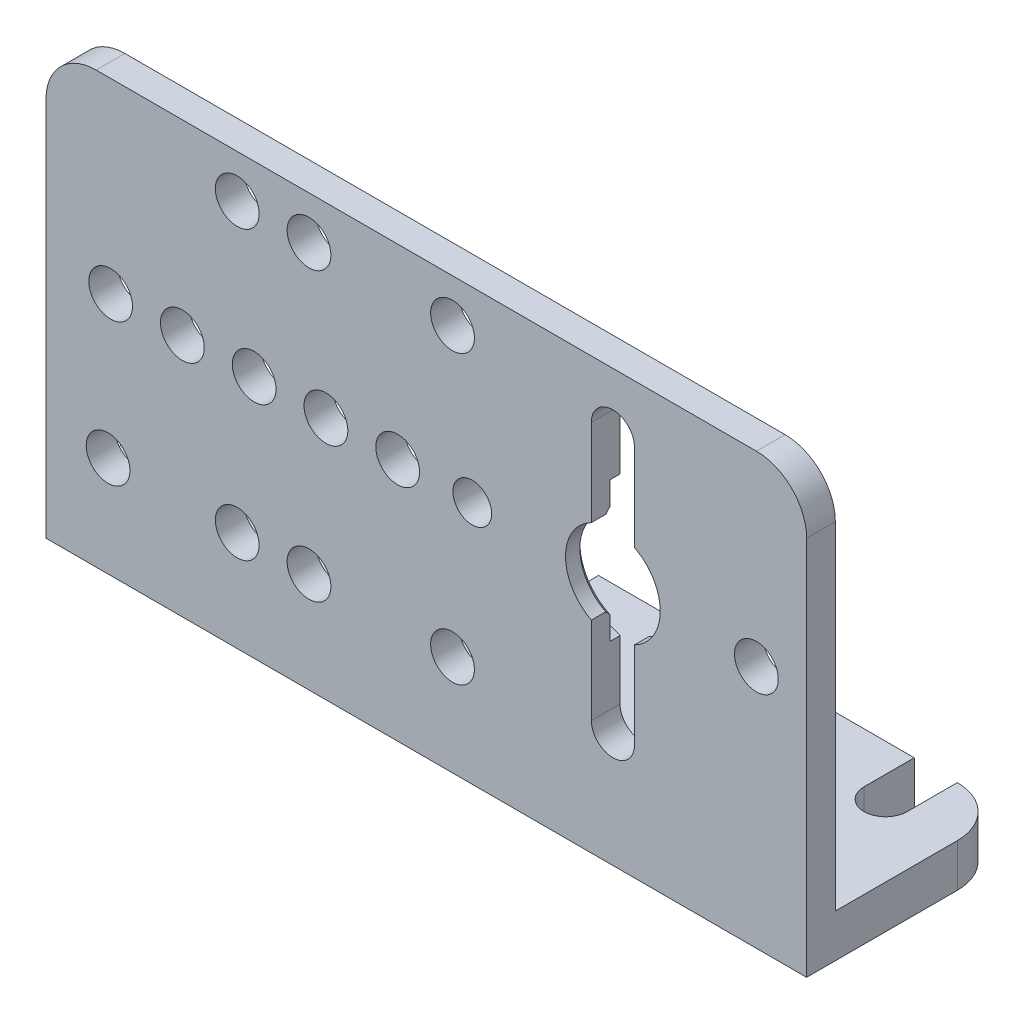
ISO-10303-21;
HEADER;
FILE_DESCRIPTION(('STEP AP214'),'2;1');
FILE_NAME('part.step','',(''),(''),'','','');
FILE_SCHEMA(('AUTOMOTIVE_DESIGN { 1 0 10303 214 1 1 1 1 }'));
ENDSEC;
DATA;
#1=APPLICATION_CONTEXT('core data for automotive mechanical design processes');
#2=APPLICATION_PROTOCOL_DEFINITION('international standard','automotive_design',2000,#1);
#3=PRODUCT_CONTEXT('',#1,'mechanical');
#4=PRODUCT('Part','Part','',(#3));
#5=PRODUCT_RELATED_PRODUCT_CATEGORY('part','',(#4));
#6=PRODUCT_DEFINITION_FORMATION('','',#4);
#7=PRODUCT_DEFINITION_CONTEXT('part definition',#1,'design');
#8=PRODUCT_DEFINITION('design','',#6,#7);
#9=PRODUCT_DEFINITION_SHAPE('','',#8);
#10=(LENGTH_UNIT() NAMED_UNIT(*) SI_UNIT(.MILLI.,.METRE.));
#11=(NAMED_UNIT(*) PLANE_ANGLE_UNIT() SI_UNIT($,.RADIAN.));
#12=(NAMED_UNIT(*) SI_UNIT($,.STERADIAN.) SOLID_ANGLE_UNIT());
#13=UNCERTAINTY_MEASURE_WITH_UNIT(LENGTH_MEASURE(1.E-05),#10,'distance_accuracy_value','');
#14=(GEOMETRIC_REPRESENTATION_CONTEXT(3) GLOBAL_UNCERTAINTY_ASSIGNED_CONTEXT((#13)) GLOBAL_UNIT_ASSIGNED_CONTEXT((#10,
#11,#12)) REPRESENTATION_CONTEXT('',''));
#15=CARTESIAN_POINT('',(0.,0.,0.));
#16=DIRECTION('',(0.,0.,1.));
#17=DIRECTION('',(1.,0.,0.));
#18=AXIS2_PLACEMENT_3D('',#15,#16,#17);
#19=CARTESIAN_POINT('',(13.,17.,0.));
#20=DIRECTION('',(0.,0.,-1.));
#21=DIRECTION('',(-1.,0.,0.));
#22=AXIS2_PLACEMENT_3D('',#19,#20,#21);
#23=CYLINDRICAL_SURFACE('',#22,3.3);
#24=DIRECTION('',(0.,0.,-1.));
#25=VECTOR('',#24,1.);
#26=CARTESIAN_POINT('',(11.5,14.0606123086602,0.));
#27=LINE('',#26,#25);
#28=CARTESIAN_POINT('',(11.5,14.0606123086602,0.));
#29=VERTEX_POINT('',#28);
#30=CARTESIAN_POINT('',(11.5,14.0606123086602,-1.));
#31=VERTEX_POINT('',#30);
#32=EDGE_CURVE('E313',#29,#31,#27,.T.);
#33=ORIENTED_EDGE('',*,*,#32,.T.);
#34=CARTESIAN_POINT('',(13.,17.,-1.));
#35=DIRECTION('',(0.,0.,-1.));
#36=DIRECTION('',(-1.,0.,0.));
#37=AXIS2_PLACEMENT_3D('',#34,#35,#36);
#38=CIRCLE('',#37,3.3);
#39=CARTESIAN_POINT('',(11.5,19.9393876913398,-1.));
#40=VERTEX_POINT('',#39);
#41=EDGE_CURVE('E575',#31,#40,#38,.T.);
#42=ORIENTED_EDGE('',*,*,#41,.T.);
#43=DIRECTION('',(0.,0.,-1.));
#44=VECTOR('',#43,1.);
#45=CARTESIAN_POINT('',(11.5,19.9393876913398,0.));
#46=LINE('',#45,#44);
#47=CARTESIAN_POINT('',(11.5,19.9393876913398,0.));
#48=VERTEX_POINT('',#47);
#49=EDGE_CURVE('E311',#48,#40,#46,.T.);
#50=ORIENTED_EDGE('',*,*,#49,.F.);
#51=CARTESIAN_POINT('',(13.,17.,0.));
#52=DIRECTION('',(0.,0.,-1.));
#53=DIRECTION('',(-1.,0.,0.));
#54=AXIS2_PLACEMENT_3D('',#51,#52,#53);
#55=CIRCLE('',#54,3.3);
#56=EDGE_CURVE('E643',#29,#48,#55,.T.);
#57=ORIENTED_EDGE('',*,*,#56,.F.);
#58=EDGE_LOOP('',(#33,#42,#50,#57));
#59=FACE_BOUND('',#58,.T.);
#60=ADVANCED_FACE('F39',(#59),#23,.F.);
#61=CARTESIAN_POINT('',(13.,17.,0.));
#62=DIRECTION('',(0.,0.,-1.));
#63=DIRECTION('',(-1.,0.,0.));
#64=AXIS2_PLACEMENT_3D('',#61,#62,#63);
#65=CYLINDRICAL_SURFACE('',#64,3.3);
#66=DIRECTION('',(0.,0.,-1.));
#67=VECTOR('',#66,1.);
#68=CARTESIAN_POINT('',(14.5,19.9393876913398,0.));
#69=LINE('',#68,#67);
#70=CARTESIAN_POINT('',(14.5,19.9393876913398,0.));
#71=VERTEX_POINT('',#70);
#72=CARTESIAN_POINT('',(14.5,19.9393876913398,-1.));
#73=VERTEX_POINT('',#72);
#74=EDGE_CURVE('E323',#71,#73,#69,.T.);
#75=ORIENTED_EDGE('',*,*,#74,.T.);
#76=CARTESIAN_POINT('',(13.,17.,-1.));
#77=DIRECTION('',(0.,0.,-1.));
#78=DIRECTION('',(-1.,0.,0.));
#79=AXIS2_PLACEMENT_3D('',#76,#77,#78);
#80=CIRCLE('',#79,3.3);
#81=CARTESIAN_POINT('',(14.5,14.0606123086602,-1.));
#82=VERTEX_POINT('',#81);
#83=EDGE_CURVE('E52',#73,#82,#80,.T.);
#84=ORIENTED_EDGE('',*,*,#83,.T.);
#85=DIRECTION('',(0.,0.,-1.));
#86=VECTOR('',#85,1.);
#87=CARTESIAN_POINT('',(14.5,14.0606123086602,0.));
#88=LINE('',#87,#86);
#89=CARTESIAN_POINT('',(14.5,14.0606123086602,0.));
#90=VERTEX_POINT('',#89);
#91=EDGE_CURVE('E321',#90,#82,#88,.T.);
#92=ORIENTED_EDGE('',*,*,#91,.F.);
#93=CARTESIAN_POINT('',(13.,17.,0.));
#94=DIRECTION('',(0.,0.,-1.));
#95=DIRECTION('',(-1.,0.,0.));
#96=AXIS2_PLACEMENT_3D('',#93,#94,#95);
#97=CIRCLE('',#96,3.3);
#98=EDGE_CURVE('E668',#71,#90,#97,.T.);
#99=ORIENTED_EDGE('',*,*,#98,.F.);
#100=EDGE_LOOP('',(#75,#84,#92,#99));
#101=FACE_BOUND('',#100,.T.);
#102=ADVANCED_FACE('F596',(#101),#65,.F.);
#103=CARTESIAN_POINT('',(26.5,0.,-14.));
#104=DIRECTION('',(0.,0.,1.));
#105=DIRECTION('',(1.,0.,0.));
#106=AXIS2_PLACEMENT_3D('',#103,#104,#105);
#107=PLANE('',#106);
#108=DIRECTION('',(-1.,0.,0.));
#109=VECTOR('',#108,1.);
#110=CARTESIAN_POINT('',(26.5,3.,-14.));
#111=LINE('',#110,#109);
#112=CARTESIAN_POINT('',(-5.,3.,-14.));
#113=VERTEX_POINT('',#112);
#114=CARTESIAN_POINT('',(-17.,3.,-14.));
#115=VERTEX_POINT('',#114);
#116=EDGE_CURVE('E516',#113,#115,#111,.T.);
#117=ORIENTED_EDGE('',*,*,#116,.F.);
#118=DIRECTION('',(0.,1.,0.));
#119=VECTOR('',#118,1.);
#120=CARTESIAN_POINT('',(-5.,0.,-14.));
#121=LINE('',#120,#119);
#122=CARTESIAN_POINT('',(-5.,0.,-14.));
#123=VERTEX_POINT('',#122);
#124=EDGE_CURVE('E447',#123,#113,#121,.T.);
#125=ORIENTED_EDGE('',*,*,#124,.F.);
#126=DIRECTION('',(-1.,0.,0.));
#127=VECTOR('',#126,1.);
#128=CARTESIAN_POINT('',(26.5,0.,-14.));
#129=LINE('',#128,#127);
#130=CARTESIAN_POINT('',(-17.,0.,-14.));
#131=VERTEX_POINT('',#130);
#132=EDGE_CURVE('E520',#123,#131,#129,.T.);
#133=ORIENTED_EDGE('',*,*,#132,.T.);
#134=DIRECTION('',(0.,1.,0.));
#135=VECTOR('',#134,1.);
#136=CARTESIAN_POINT('',(-17.,0.,-14.));
#137=LINE('',#136,#135);
#138=EDGE_CURVE('E477',#131,#115,#137,.T.);
#139=ORIENTED_EDGE('',*,*,#138,.T.);
#140=EDGE_LOOP('',(#117,#125,#133,#139));
#141=FACE_BOUND('',#140,.T.);
#142=ADVANCED_FACE('F599',(#141),#107,.F.);
#143=CARTESIAN_POINT('',(-20.,3.,-14.));
#144=VERTEX_POINT('',#143);
#145=CARTESIAN_POINT('',(-23.,3.,-14.));
#146=VERTEX_POINT('',#145);
#147=EDGE_CURVE('E512',#144,#146,#111,.T.);
#148=ORIENTED_EDGE('',*,*,#147,.F.);
#149=DIRECTION('',(0.,1.,0.));
#150=VECTOR('',#149,1.);
#151=CARTESIAN_POINT('',(-20.,0.,-14.));
#152=LINE('',#151,#150);
#153=CARTESIAN_POINT('',(-20.,0.,-14.));
#154=VERTEX_POINT('',#153);
#155=EDGE_CURVE('E474',#154,#144,#152,.T.);
#156=ORIENTED_EDGE('',*,*,#155,.F.);
#157=CARTESIAN_POINT('',(-23.,0.,-14.));
#158=VERTEX_POINT('',#157);
#159=EDGE_CURVE('E515',#154,#158,#129,.T.);
#160=ORIENTED_EDGE('',*,*,#159,.T.);
#161=DIRECTION('',(0.,1.,0.));
#162=VECTOR('',#161,1.);
#163=CARTESIAN_POINT('',(-23.,0.,-14.));
#164=LINE('',#163,#162);
#165=EDGE_CURVE('E525',#158,#146,#164,.T.);
#166=ORIENTED_EDGE('',*,*,#165,.T.);
#167=EDGE_LOOP('',(#148,#156,#160,#166));
#168=FACE_BOUND('',#167,.T.);
#169=ADVANCED_FACE('F823',(#168),#107,.F.);
#170=CARTESIAN_POINT('',(26.5,30.,0.));
#171=DIRECTION('',(0.,0.,-1.));
#172=DIRECTION('',(0.,1.,0.));
#173=AXIS2_PLACEMENT_3D('',#170,#171,#172);
#174=PLANE('',#173);
#175=CARTESIAN_POINT('',(-22.1746021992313,7.,0.));
#176=DIRECTION('',(0.,0.,-1.));
#177=DIRECTION('',(-1.,0.,0.));
#178=AXIS2_PLACEMENT_3D('',#175,#176,#177);
#179=CIRCLE('',#178,1.525);
#180=CARTESIAN_POINT('',(-23.6996021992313,7.,0.));
#181=VERTEX_POINT('',#180);
#182=EDGE_CURVE('E661',#181,#181,#179,.T.);
#183=ORIENTED_EDGE('',*,*,#182,.T.);
#184=EDGE_LOOP('',(#183));
#185=FACE_BOUND('',#184,.T.);
#186=DIRECTION('',(0.,1.,0.));
#187=VECTOR('',#186,1.);
#188=CARTESIAN_POINT('',(11.5,26.,0.));
#189=LINE('',#188,#187);
#190=CARTESIAN_POINT('',(11.5,26.,0.));
#191=VERTEX_POINT('',#190);
#192=EDGE_CURVE('E328',#48,#191,#189,.T.);
#193=ORIENTED_EDGE('',*,*,#192,.T.);
#194=CARTESIAN_POINT('',(13.,26.,0.));
#195=DIRECTION('',(0.,0.,-1.));
#196=DIRECTION('',(-1.,0.,0.));
#197=AXIS2_PLACEMENT_3D('',#194,#195,#196);
#198=CIRCLE('',#197,1.5);
#199=CARTESIAN_POINT('',(14.5,26.,0.));
#200=VERTEX_POINT('',#199);
#201=EDGE_CURVE('E298',#191,#200,#198,.T.);
#202=ORIENTED_EDGE('',*,*,#201,.T.);
#203=DIRECTION('',(0.,-1.,0.));
#204=VECTOR('',#203,1.);
#205=CARTESIAN_POINT('',(14.5,26.,0.));
#206=LINE('',#205,#204);
#207=EDGE_CURVE('E302',#200,#71,#206,.T.);
#208=ORIENTED_EDGE('',*,*,#207,.T.);
#209=ORIENTED_EDGE('',*,*,#98,.T.);
#210=DIRECTION('',(0.,-1.,0.));
#211=VECTOR('',#210,1.);
#212=CARTESIAN_POINT('',(14.5,14.0606123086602,0.));
#213=LINE('',#212,#211);
#214=CARTESIAN_POINT('',(14.5,8.,0.));
#215=VERTEX_POINT('',#214);
#216=EDGE_CURVE('E671',#90,#215,#213,.T.);
#217=ORIENTED_EDGE('',*,*,#216,.T.);
#218=CARTESIAN_POINT('',(13.,8.,0.));
#219=DIRECTION('',(0.,0.,-1.));
#220=DIRECTION('',(-1.,0.,0.));
#221=AXIS2_PLACEMENT_3D('',#218,#219,#220);
#222=CIRCLE('',#221,1.5);
#223=CARTESIAN_POINT('',(11.5,8.,0.));
#224=VERTEX_POINT('',#223);
#225=EDGE_CURVE('E674',#215,#224,#222,.T.);
#226=ORIENTED_EDGE('',*,*,#225,.T.);
#227=DIRECTION('',(0.,1.,0.));
#228=VECTOR('',#227,1.);
#229=CARTESIAN_POINT('',(11.5,14.0606123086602,0.));
#230=LINE('',#229,#228);
#231=EDGE_CURVE('E677',#224,#29,#230,.T.);
#232=ORIENTED_EDGE('',*,*,#231,.T.);
#233=ORIENTED_EDGE('',*,*,#56,.T.);
#234=EDGE_LOOP('',(#193,#202,#208,#209,#217,#226,#232,#233));
#235=FACE_BOUND('',#234,.T.);
#236=CARTESIAN_POINT('',(3.2,17.,0.));
#237=DIRECTION('',(0.,0.,-1.));
#238=DIRECTION('',(-1.,0.,0.));
#239=AXIS2_PLACEMENT_3D('',#236,#237,#238);
#240=CIRCLE('',#239,1.35);
#241=CARTESIAN_POINT('',(1.85,17.,0.));
#242=VERTEX_POINT('',#241);
#243=EDGE_CURVE('E329',#242,#242,#240,.T.);
#244=ORIENTED_EDGE('',*,*,#243,.T.);
#245=EDGE_LOOP('',(#244));
#246=FACE_BOUND('',#245,.T.);
#247=CARTESIAN_POINT('',(-13.1746021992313,27.,0.));
#248=DIRECTION('',(0.,0.,-1.));
#249=DIRECTION('',(1.,0.,0.));
#250=AXIS2_PLACEMENT_3D('',#247,#248,#249);
#251=CIRCLE('',#250,1.525);
#252=CARTESIAN_POINT('',(-11.6496021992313,27.,0.));
#253=VERTEX_POINT('',#252);
#254=EDGE_CURVE('E335',#253,#253,#251,.T.);
#255=ORIENTED_EDGE('',*,*,#254,.T.);
#256=EDGE_LOOP('',(#255));
#257=FACE_BOUND('',#256,.T.);
#258=CARTESIAN_POINT('',(-13.1746021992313,7.,0.));
#259=DIRECTION('',(0.,0.,-1.));
#260=DIRECTION('',(-1.,0.,0.));
#261=AXIS2_PLACEMENT_3D('',#258,#259,#260);
#262=CIRCLE('',#261,1.525);
#263=CARTESIAN_POINT('',(-14.6996021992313,7.,0.));
#264=VERTEX_POINT('',#263);
#265=EDGE_CURVE('E341',#264,#264,#262,.T.);
#266=ORIENTED_EDGE('',*,*,#265,.T.);
#267=EDGE_LOOP('',(#266));
#268=FACE_BOUND('',#267,.T.);
#269=CARTESIAN_POINT('',(-21.9957238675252,17.,0.));
#270=DIRECTION('',(0.,0.,-1.));
#271=DIRECTION('',(-1.,0.,0.));
#272=AXIS2_PLACEMENT_3D('',#269,#270,#271);
#273=CIRCLE('',#272,1.525);
#274=CARTESIAN_POINT('',(-23.5207238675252,17.,0.));
#275=VERTEX_POINT('',#274);
#276=EDGE_CURVE('E347',#275,#275,#273,.T.);
#277=ORIENTED_EDGE('',*,*,#276,.T.);
#278=EDGE_LOOP('',(#277));
#279=FACE_BOUND('',#278,.T.);
#280=CARTESIAN_POINT('',(1.82539780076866,27.,0.));
#281=DIRECTION('',(0.,0.,-1.));
#282=DIRECTION('',(1.,0.,0.));
#283=AXIS2_PLACEMENT_3D('',#280,#281,#282);
#284=CIRCLE('',#283,1.525);
#285=CARTESIAN_POINT('',(3.35039780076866,27.,0.));
#286=VERTEX_POINT('',#285);
#287=EDGE_CURVE('E353',#286,#286,#284,.T.);
#288=ORIENTED_EDGE('',*,*,#287,.T.);
#289=EDGE_LOOP('',(#288));
#290=FACE_BOUND('',#289,.T.);
#291=CARTESIAN_POINT('',(-16.9957238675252,17.,0.));
#292=DIRECTION('',(0.,0.,-1.));
#293=DIRECTION('',(-1.,0.,0.));
#294=AXIS2_PLACEMENT_3D('',#291,#292,#293);
#295=CIRCLE('',#294,1.525);
#296=CARTESIAN_POINT('',(-18.5207238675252,17.,0.));
#297=VERTEX_POINT('',#296);
#298=EDGE_CURVE('E359',#297,#297,#295,.T.);
#299=ORIENTED_EDGE('',*,*,#298,.T.);
#300=EDGE_LOOP('',(#299));
#301=FACE_BOUND('',#300,.T.);
#302=CARTESIAN_POINT('',(23.,17.,0.));
#303=DIRECTION('',(0.,0.,-1.));
#304=DIRECTION('',(-1.,0.,0.));
#305=AXIS2_PLACEMENT_3D('',#302,#303,#304);
#306=CIRCLE('',#305,1.525);
#307=CARTESIAN_POINT('',(21.475,17.,0.));
#308=VERTEX_POINT('',#307);
#309=EDGE_CURVE('E365',#308,#308,#306,.T.);
#310=ORIENTED_EDGE('',*,*,#309,.T.);
#311=EDGE_LOOP('',(#310));
#312=FACE_BOUND('',#311,.T.);
#313=CARTESIAN_POINT('',(-11.9957238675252,17.,0.));
#314=DIRECTION('',(0.,0.,-1.));
#315=DIRECTION('',(-1.,0.,0.));
#316=AXIS2_PLACEMENT_3D('',#313,#314,#315);
#317=CIRCLE('',#316,1.525);
#318=CARTESIAN_POINT('',(-13.5207238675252,17.,0.));
#319=VERTEX_POINT('',#318);
#320=EDGE_CURVE('E371',#319,#319,#317,.T.);
#321=ORIENTED_EDGE('',*,*,#320,.T.);
#322=EDGE_LOOP('',(#321));
#323=FACE_BOUND('',#322,.T.);
#324=CARTESIAN_POINT('',(-6.99572386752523,17.,0.));
#325=DIRECTION('',(0.,0.,-1.));
#326=DIRECTION('',(-1.,0.,0.));
#327=AXIS2_PLACEMENT_3D('',#324,#325,#326);
#328=CIRCLE('',#327,1.525);
#329=CARTESIAN_POINT('',(-8.52072386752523,17.,0.));
#330=VERTEX_POINT('',#329);
#331=EDGE_CURVE('E377',#330,#330,#328,.T.);
#332=ORIENTED_EDGE('',*,*,#331,.T.);
#333=EDGE_LOOP('',(#332));
#334=FACE_BOUND('',#333,.T.);
#335=CARTESIAN_POINT('',(-8.17460219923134,27.,0.));
#336=DIRECTION('',(0.,0.,-1.));
#337=DIRECTION('',(1.,0.,0.));
#338=AXIS2_PLACEMENT_3D('',#335,#336,#337);
#339=CIRCLE('',#338,1.525);
#340=CARTESIAN_POINT('',(-6.64960219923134,27.,0.));
#341=VERTEX_POINT('',#340);
#342=EDGE_CURVE('E383',#341,#341,#339,.T.);
#343=ORIENTED_EDGE('',*,*,#342,.T.);
#344=EDGE_LOOP('',(#343));
#345=FACE_BOUND('',#344,.T.);
#346=CARTESIAN_POINT('',(-8.17460219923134,7.,0.));
#347=DIRECTION('',(0.,0.,-1.));
#348=DIRECTION('',(-1.,0.,0.));
#349=AXIS2_PLACEMENT_3D('',#346,#347,#348);
#350=CIRCLE('',#349,1.525);
#351=CARTESIAN_POINT('',(-9.69960219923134,7.,0.));
#352=VERTEX_POINT('',#351);
#353=EDGE_CURVE('E389',#352,#352,#350,.T.);
#354=ORIENTED_EDGE('',*,*,#353,.T.);
#355=EDGE_LOOP('',(#354));
#356=FACE_BOUND('',#355,.T.);
#357=CARTESIAN_POINT('',(1.82539780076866,7.,0.));
#358=DIRECTION('',(0.,0.,-1.));
#359=DIRECTION('',(-1.,0.,0.));
#360=AXIS2_PLACEMENT_3D('',#357,#358,#359);
#361=CIRCLE('',#360,1.525);
#362=CARTESIAN_POINT('',(0.300397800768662,7.,0.));
#363=VERTEX_POINT('',#362);
#364=EDGE_CURVE('E395',#363,#363,#361,.T.);
#365=ORIENTED_EDGE('',*,*,#364,.T.);
#366=EDGE_LOOP('',(#365));
#367=FACE_BOUND('',#366,.T.);
#368=CARTESIAN_POINT('',(-1.99572386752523,17.,0.));
#369=DIRECTION('',(0.,0.,-1.));
#370=DIRECTION('',(-1.,0.,0.));
#371=AXIS2_PLACEMENT_3D('',#368,#369,#370);
#372=CIRCLE('',#371,1.525);
#373=CARTESIAN_POINT('',(-3.52072386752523,17.,0.));
#374=VERTEX_POINT('',#373);
#375=EDGE_CURVE('E401',#374,#374,#372,.T.);
#376=ORIENTED_EDGE('',*,*,#375,.T.);
#377=EDGE_LOOP('',(#376));
#378=FACE_BOUND('',#377,.T.);
#379=DIRECTION('',(0.,-1.,0.));
#380=VECTOR('',#379,1.);
#381=CARTESIAN_POINT('',(26.5,30.,0.));
#382=LINE('',#381,#380);
#383=CARTESIAN_POINT('',(26.5,26.5,0.));
#384=VERTEX_POINT('',#383);
#385=CARTESIAN_POINT('',(26.5,0.,0.));
#386=VERTEX_POINT('',#385);
#387=EDGE_CURVE('E484',#384,#386,#382,.T.);
#388=ORIENTED_EDGE('',*,*,#387,.F.);
#389=CARTESIAN_POINT('',(23.,26.5,0.));
#390=DIRECTION('',(0.,0.,-1.));
#391=DIRECTION('',(0.,1.,0.));
#392=AXIS2_PLACEMENT_3D('',#389,#390,#391);
#393=CIRCLE('',#392,3.5);
#394=CARTESIAN_POINT('',(23.,30.,0.));
#395=VERTEX_POINT('',#394);
#396=EDGE_CURVE('E550',#384,#395,#393,.F.);
#397=ORIENTED_EDGE('',*,*,#396,.T.);
#398=DIRECTION('',(-1.,0.,0.));
#399=VECTOR('',#398,1.);
#400=CARTESIAN_POINT('',(26.5,30.,0.));
#401=LINE('',#400,#399);
#402=CARTESIAN_POINT('',(-23.,30.,0.));
#403=VERTEX_POINT('',#402);
#404=EDGE_CURVE('E495',#395,#403,#401,.T.);
#405=ORIENTED_EDGE('',*,*,#404,.T.);
#406=CARTESIAN_POINT('',(-23.,26.5,0.));
#407=DIRECTION('',(0.,0.,-1.));
#408=DIRECTION('',(0.,1.,0.));
#409=AXIS2_PLACEMENT_3D('',#406,#407,#408);
#410=CIRCLE('',#409,3.5);
#411=CARTESIAN_POINT('',(-26.5,26.5,0.));
#412=VERTEX_POINT('',#411);
#413=EDGE_CURVE('E548',#403,#412,#410,.F.);
#414=ORIENTED_EDGE('',*,*,#413,.T.);
#415=DIRECTION('',(0.,-1.,0.));
#416=VECTOR('',#415,1.);
#417=CARTESIAN_POINT('',(-26.5,30.,0.));
#418=LINE('',#417,#416);
#419=CARTESIAN_POINT('',(-26.5,0.,0.));
#420=VERTEX_POINT('',#419);
#421=EDGE_CURVE('E476',#412,#420,#418,.T.);
#422=ORIENTED_EDGE('',*,*,#421,.T.);
#423=DIRECTION('',(-1.,0.,0.));
#424=VECTOR('',#423,1.);
#425=CARTESIAN_POINT('',(26.5,0.,0.));
#426=LINE('',#425,#424);
#427=EDGE_CURVE('E519',#386,#420,#426,.T.);
#428=ORIENTED_EDGE('',*,*,#427,.F.);
#429=EDGE_LOOP('',(#388,#397,#405,#414,#422,#428));
#430=FACE_BOUND('',#429,.T.);
#431=ADVANCED_FACE('F692',(#185,#235,#246,#257,#268,#279,#290,#301,#312,#323,#334,#345,#356,
#367,#378,#430),#174,.F.);
#432=CARTESIAN_POINT('',(26.5,0.,0.));
#433=DIRECTION('',(0.,1.,0.));
#434=DIRECTION('',(0.,0.,1.));
#435=AXIS2_PLACEMENT_3D('',#432,#433,#434);
#436=PLANE('',#435);
#437=CARTESIAN_POINT('',(20.,0.,-14.));
#438=VERTEX_POINT('',#437);
#439=CARTESIAN_POINT('',(-2.,0.,-14.));
#440=VERTEX_POINT('',#439);
#441=EDGE_CURVE('E517',#438,#440,#129,.T.);
#442=ORIENTED_EDGE('',*,*,#441,.F.);
#443=DIRECTION('',(0.,0.,1.));
#444=VECTOR('',#443,1.);
#445=CARTESIAN_POINT('',(20.,0.,-14.));
#446=LINE('',#445,#444);
#447=CARTESIAN_POINT('',(20.,0.,-10.5));
#448=VERTEX_POINT('',#447);
#449=EDGE_CURVE('E407',#438,#448,#446,.T.);
#450=ORIENTED_EDGE('',*,*,#449,.T.);
#451=CARTESIAN_POINT('',(21.5,0.,-10.5));
#452=DIRECTION('',(0.,1.,0.));
#453=DIRECTION('',(0.,0.,1.));
#454=AXIS2_PLACEMENT_3D('',#451,#452,#453);
#455=CIRCLE('',#454,1.5);
#456=CARTESIAN_POINT('',(23.,0.,-10.5));
#457=VERTEX_POINT('',#456);
#458=EDGE_CURVE('E410',#448,#457,#455,.T.);
#459=ORIENTED_EDGE('',*,*,#458,.T.);
#460=DIRECTION('',(0.,0.,-1.));
#461=VECTOR('',#460,1.);
#462=CARTESIAN_POINT('',(23.,0.,-14.));
#463=LINE('',#462,#461);
#464=CARTESIAN_POINT('',(23.,0.,-14.));
#465=VERTEX_POINT('',#464);
#466=EDGE_CURVE('E414',#457,#465,#463,.T.);
#467=ORIENTED_EDGE('',*,*,#466,.T.);
#468=CARTESIAN_POINT('',(23.,0.,-10.5));
#469=DIRECTION('',(0.,1.,0.));
#470=DIRECTION('',(0.,0.,1.));
#471=AXIS2_PLACEMENT_3D('',#468,#469,#470);
#472=CIRCLE('',#471,3.5);
#473=CARTESIAN_POINT('',(26.5,0.,-10.5));
#474=VERTEX_POINT('',#473);
#475=EDGE_CURVE('E537',#465,#474,#472,.F.);
#476=ORIENTED_EDGE('',*,*,#475,.T.);
#477=DIRECTION('',(0.,0.,-1.));
#478=VECTOR('',#477,1.);
#479=CARTESIAN_POINT('',(26.5,0.,0.));
#480=LINE('',#479,#478);
#481=EDGE_CURVE('E486',#386,#474,#480,.T.);
#482=ORIENTED_EDGE('',*,*,#481,.F.);
#483=ORIENTED_EDGE('',*,*,#427,.T.);
#484=DIRECTION('',(0.,0.,-1.));
#485=VECTOR('',#484,1.);
#486=CARTESIAN_POINT('',(-26.5,0.,0.));
#487=LINE('',#486,#485);
#488=CARTESIAN_POINT('',(-26.5,0.,-10.5));
#489=VERTEX_POINT('',#488);
#490=EDGE_CURVE('E497',#420,#489,#487,.T.);
#491=ORIENTED_EDGE('',*,*,#490,.T.);
#492=CARTESIAN_POINT('',(-23.,0.,-10.5));
#493=DIRECTION('',(0.,1.,0.));
#494=DIRECTION('',(0.,0.,1.));
#495=AXIS2_PLACEMENT_3D('',#492,#493,#494);
#496=CIRCLE('',#495,3.5);
#497=EDGE_CURVE('E539',#489,#158,#496,.F.);
#498=ORIENTED_EDGE('',*,*,#497,.T.);
#499=ORIENTED_EDGE('',*,*,#159,.F.);
#500=DIRECTION('',(0.,0.,1.));
#501=VECTOR('',#500,1.);
#502=CARTESIAN_POINT('',(-20.,0.,-14.));
#503=LINE('',#502,#501);
#504=CARTESIAN_POINT('',(-20.,0.,-10.5));
#505=VERTEX_POINT('',#504);
#506=EDGE_CURVE('E457',#154,#505,#503,.T.);
#507=ORIENTED_EDGE('',*,*,#506,.T.);
#508=CARTESIAN_POINT('',(-18.5,0.,-10.5));
#509=DIRECTION('',(0.,1.,0.));
#510=DIRECTION('',(0.,0.,-1.));
#511=AXIS2_PLACEMENT_3D('',#508,#509,#510);
#512=CIRCLE('',#511,1.5);
#513=CARTESIAN_POINT('',(-17.,0.,-10.5));
#514=VERTEX_POINT('',#513);
#515=EDGE_CURVE('E460',#505,#514,#512,.T.);
#516=ORIENTED_EDGE('',*,*,#515,.T.);
#517=DIRECTION('',(0.,0.,-1.));
#518=VECTOR('',#517,1.);
#519=CARTESIAN_POINT('',(-17.,0.,-14.));
#520=LINE('',#519,#518);
#521=EDGE_CURVE('E464',#514,#131,#520,.T.);
#522=ORIENTED_EDGE('',*,*,#521,.T.);
#523=ORIENTED_EDGE('',*,*,#132,.F.);
#524=DIRECTION('',(0.,0.,1.));
#525=VECTOR('',#524,1.);
#526=CARTESIAN_POINT('',(-5.,0.,-14.));
#527=LINE('',#526,#525);
#528=CARTESIAN_POINT('',(-5.,0.,-10.5));
#529=VERTEX_POINT('',#528);
#530=EDGE_CURVE('E430',#123,#529,#527,.T.);
#531=ORIENTED_EDGE('',*,*,#530,.T.);
#532=CARTESIAN_POINT('',(-3.5,0.,-10.5));
#533=DIRECTION('',(0.,1.,0.));
#534=DIRECTION('',(0.,0.,1.));
#535=AXIS2_PLACEMENT_3D('',#532,#533,#534);
#536=CIRCLE('',#535,1.5);
#537=CARTESIAN_POINT('',(-2.,0.,-10.5));
#538=VERTEX_POINT('',#537);
#539=EDGE_CURVE('E433',#529,#538,#536,.T.);
#540=ORIENTED_EDGE('',*,*,#539,.T.);
#541=DIRECTION('',(0.,0.,-1.));
#542=VECTOR('',#541,1.);
#543=CARTESIAN_POINT('',(-2.,0.,-14.));
#544=LINE('',#543,#542);
#545=EDGE_CURVE('E437',#538,#440,#544,.T.);
#546=ORIENTED_EDGE('',*,*,#545,.T.);
#547=EDGE_LOOP('',(#442,#450,#459,#467,#476,#482,#483,#491,#498,#499,#507,#516,#522,#523,#531,
#540,#546));
#548=FACE_BOUND('',#547,.T.);
#549=ADVANCED_FACE('F821',(#548),#436,.F.);
#550=CARTESIAN_POINT('',(20.,3.,-14.));
#551=VERTEX_POINT('',#550);
#552=CARTESIAN_POINT('',(-2.,3.,-14.));
#553=VERTEX_POINT('',#552);
#554=EDGE_CURVE('E513',#551,#553,#111,.T.);
#555=ORIENTED_EDGE('',*,*,#554,.F.);
#556=DIRECTION('',(0.,1.,0.));
#557=VECTOR('',#556,1.);
#558=CARTESIAN_POINT('',(20.,0.,-14.));
#559=LINE('',#558,#557);
#560=EDGE_CURVE('E424',#438,#551,#559,.T.);
#561=ORIENTED_EDGE('',*,*,#560,.F.);
#562=ORIENTED_EDGE('',*,*,#441,.T.);
#563=DIRECTION('',(0.,1.,0.));
#564=VECTOR('',#563,1.);
#565=CARTESIAN_POINT('',(-2.,0.,-14.));
#566=LINE('',#565,#564);
#567=EDGE_CURVE('E450',#440,#553,#566,.T.);
#568=ORIENTED_EDGE('',*,*,#567,.T.);
#569=EDGE_LOOP('',(#555,#561,#562,#568));
#570=FACE_BOUND('',#569,.T.);
#571=ADVANCED_FACE('F817',(#570),#107,.F.);
#572=CARTESIAN_POINT('',(26.5,3.,-14.));
#573=DIRECTION('',(0.,-1.,0.));
#574=DIRECTION('',(0.,0.,-1.));
#575=AXIS2_PLACEMENT_3D('',#572,#573,#574);
#576=PLANE('',#575);
#577=CARTESIAN_POINT('',(21.5,3.,-10.5));
#578=DIRECTION('',(0.,1.,0.));
#579=DIRECTION('',(0.,0.,1.));
#580=AXIS2_PLACEMENT_3D('',#577,#578,#579);
#581=CIRCLE('',#580,1.5);
#582=CARTESIAN_POINT('',(20.,3.,-10.5));
#583=VERTEX_POINT('',#582);
#584=CARTESIAN_POINT('',(23.,3.,-10.5));
#585=VERTEX_POINT('',#584);
#586=EDGE_CURVE('E420',#583,#585,#581,.T.);
#587=ORIENTED_EDGE('',*,*,#586,.F.);
#588=DIRECTION('',(0.,0.,1.));
#589=VECTOR('',#588,1.);
#590=CARTESIAN_POINT('',(20.,3.,-14.));
#591=LINE('',#590,#589);
#592=EDGE_CURVE('E404',#551,#583,#591,.T.);
#593=ORIENTED_EDGE('',*,*,#592,.F.);
#594=ORIENTED_EDGE('',*,*,#554,.T.);
#595=DIRECTION('',(0.,0.,-1.));
#596=VECTOR('',#595,1.);
#597=CARTESIAN_POINT('',(-2.,3.,-14.));
#598=LINE('',#597,#596);
#599=CARTESIAN_POINT('',(-2.,3.,-10.5));
#600=VERTEX_POINT('',#599);
#601=EDGE_CURVE('E434',#600,#553,#598,.T.);
#602=ORIENTED_EDGE('',*,*,#601,.F.);
#603=CARTESIAN_POINT('',(-3.5,3.,-10.5));
#604=DIRECTION('',(0.,1.,0.));
#605=DIRECTION('',(0.,0.,1.));
#606=AXIS2_PLACEMENT_3D('',#603,#604,#605);
#607=CIRCLE('',#606,1.5);
#608=CARTESIAN_POINT('',(-5.,3.,-10.5));
#609=VERTEX_POINT('',#608);
#610=EDGE_CURVE('E442',#609,#600,#607,.T.);
#611=ORIENTED_EDGE('',*,*,#610,.F.);
#612=DIRECTION('',(0.,0.,1.));
#613=VECTOR('',#612,1.);
#614=CARTESIAN_POINT('',(-5.,3.,-14.));
#615=LINE('',#614,#613);
#616=EDGE_CURVE('E426',#113,#609,#615,.T.);
#617=ORIENTED_EDGE('',*,*,#616,.F.);
#618=ORIENTED_EDGE('',*,*,#116,.T.);
#619=DIRECTION('',(0.,0.,-1.));
#620=VECTOR('',#619,1.);
#621=CARTESIAN_POINT('',(-17.,3.,-14.));
#622=LINE('',#621,#620);
#623=CARTESIAN_POINT('',(-17.,3.,-10.5));
#624=VERTEX_POINT('',#623);
#625=EDGE_CURVE('E461',#624,#115,#622,.T.);
#626=ORIENTED_EDGE('',*,*,#625,.F.);
#627=CARTESIAN_POINT('',(-18.5,3.,-10.5));
#628=DIRECTION('',(0.,1.,0.));
#629=DIRECTION('',(0.,0.,-1.));
#630=AXIS2_PLACEMENT_3D('',#627,#628,#629);
#631=CIRCLE('',#630,1.5);
#632=CARTESIAN_POINT('',(-20.,3.,-10.5));
#633=VERTEX_POINT('',#632);
#634=EDGE_CURVE('E469',#633,#624,#631,.T.);
#635=ORIENTED_EDGE('',*,*,#634,.F.);
#636=DIRECTION('',(0.,0.,1.));
#637=VECTOR('',#636,1.);
#638=CARTESIAN_POINT('',(-20.,3.,-14.));
#639=LINE('',#638,#637);
#640=EDGE_CURVE('E449',#144,#633,#639,.T.);
#641=ORIENTED_EDGE('',*,*,#640,.F.);
#642=ORIENTED_EDGE('',*,*,#147,.T.);
#643=CARTESIAN_POINT('',(-23.,3.,-10.5));
#644=DIRECTION('',(0.,-1.,0.));
#645=DIRECTION('',(0.,0.,-1.));
#646=AXIS2_PLACEMENT_3D('',#643,#644,#645);
#647=CIRCLE('',#646,3.5);
#648=CARTESIAN_POINT('',(-26.5,3.,-10.5));
#649=VERTEX_POINT('',#648);
#650=EDGE_CURVE('E531',#146,#649,#647,.F.);
#651=ORIENTED_EDGE('',*,*,#650,.T.);
#652=DIRECTION('',(0.,0.,1.));
#653=VECTOR('',#652,1.);
#654=CARTESIAN_POINT('',(-26.5,3.,-14.));
#655=LINE('',#654,#653);
#656=CARTESIAN_POINT('',(-26.5,3.,-2.));
#657=VERTEX_POINT('',#656);
#658=EDGE_CURVE('E500',#649,#657,#655,.T.);
#659=ORIENTED_EDGE('',*,*,#658,.T.);
#660=DIRECTION('',(-1.,0.,0.));
#661=VECTOR('',#660,1.);
#662=CARTESIAN_POINT('',(26.5,3.,-2.));
#663=LINE('',#662,#661);
#664=CARTESIAN_POINT('',(26.5,3.,-2.));
#665=VERTEX_POINT('',#664);
#666=EDGE_CURVE('E509',#665,#657,#663,.T.);
#667=ORIENTED_EDGE('',*,*,#666,.F.);
#668=DIRECTION('',(0.,0.,1.));
#669=VECTOR('',#668,1.);
#670=CARTESIAN_POINT('',(26.5,3.,-14.));
#671=LINE('',#670,#669);
#672=CARTESIAN_POINT('',(26.5,3.,-10.5));
#673=VERTEX_POINT('',#672);
#674=EDGE_CURVE('E490',#673,#665,#671,.T.);
#675=ORIENTED_EDGE('',*,*,#674,.F.);
#676=CARTESIAN_POINT('',(23.,3.,-10.5));
#677=DIRECTION('',(0.,-1.,0.));
#678=DIRECTION('',(0.,0.,-1.));
#679=AXIS2_PLACEMENT_3D('',#676,#677,#678);
#680=CIRCLE('',#679,3.5);
#681=CARTESIAN_POINT('',(23.,3.,-14.));
#682=VERTEX_POINT('',#681);
#683=EDGE_CURVE('E528',#673,#682,#680,.F.);
#684=ORIENTED_EDGE('',*,*,#683,.T.);
#685=DIRECTION('',(0.,0.,-1.));
#686=VECTOR('',#685,1.);
#687=CARTESIAN_POINT('',(23.,3.,-14.));
#688=LINE('',#687,#686);
#689=EDGE_CURVE('E411',#585,#682,#688,.T.);
#690=ORIENTED_EDGE('',*,*,#689,.F.);
#691=EDGE_LOOP('',(#587,#593,#594,#602,#611,#617,#618,#626,#635,#641,#642,#651,#659,#667,#675,
#684,#690));
#692=FACE_BOUND('',#691,.T.);
#693=ADVANCED_FACE('F813',(#692),#576,.F.);
#694=CARTESIAN_POINT('',(26.5,3.,-2.));
#695=DIRECTION('',(0.,0.,1.));
#696=DIRECTION('',(1.,0.,0.));
#697=AXIS2_PLACEMENT_3D('',#694,#695,#696);
#698=PLANE('',#697);
#699=CARTESIAN_POINT('',(-22.1746021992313,7.,-2.));
#700=DIRECTION('',(0.,0.,-1.));
#701=DIRECTION('',(-1.,0.,0.));
#702=AXIS2_PLACEMENT_3D('',#699,#700,#701);
#703=CIRCLE('',#702,1.525);
#704=CARTESIAN_POINT('',(-23.6996021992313,7.,-2.));
#705=VERTEX_POINT('',#704);
#706=EDGE_CURVE('E291',#705,#705,#703,.T.);
#707=ORIENTED_EDGE('',*,*,#706,.F.);
#708=EDGE_LOOP('',(#707));
#709=FACE_BOUND('',#708,.T.);
#710=DIRECTION('',(0.,1.,0.));
#711=VECTOR('',#710,1.);
#712=CARTESIAN_POINT('',(11.5,26.,-2.));
#713=LINE('',#712,#711);
#714=CARTESIAN_POINT('',(11.5,21.8744230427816,-2.));
#715=VERTEX_POINT('',#714);
#716=CARTESIAN_POINT('',(11.5,26.,-2.));
#717=VERTEX_POINT('',#716);
#718=EDGE_CURVE('E287',#715,#717,#713,.T.);
#719=ORIENTED_EDGE('',*,*,#718,.F.);
#720=CARTESIAN_POINT('',(13.,17.,-2.));
#721=DIRECTION('',(0.,0.,-1.));
#722=DIRECTION('',(-1.,0.,0.));
#723=AXIS2_PLACEMENT_3D('',#720,#721,#722);
#724=CIRCLE('',#723,5.1);
#725=CARTESIAN_POINT('',(11.5,12.1255769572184,-2.));
#726=VERTEX_POINT('',#725);
#727=EDGE_CURVE('E269',#726,#715,#724,.T.);
#728=ORIENTED_EDGE('',*,*,#727,.F.);
#729=DIRECTION('',(0.,1.,0.));
#730=VECTOR('',#729,1.);
#731=CARTESIAN_POINT('',(11.5,14.0606123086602,-2.));
#732=LINE('',#731,#730);
#733=CARTESIAN_POINT('',(11.5,8.,-2.));
#734=VERTEX_POINT('',#733);
#735=EDGE_CURVE('E299',#734,#726,#732,.T.);
#736=ORIENTED_EDGE('',*,*,#735,.F.);
#737=CARTESIAN_POINT('',(13.,8.,-2.));
#738=DIRECTION('',(0.,0.,-1.));
#739=DIRECTION('',(-1.,0.,0.));
#740=AXIS2_PLACEMENT_3D('',#737,#738,#739);
#741=CIRCLE('',#740,1.5);
#742=CARTESIAN_POINT('',(14.5,8.,-2.));
#743=VERTEX_POINT('',#742);
#744=EDGE_CURVE('E304',#743,#734,#741,.T.);
#745=ORIENTED_EDGE('',*,*,#744,.F.);
#746=DIRECTION('',(0.,-1.,0.));
#747=VECTOR('',#746,1.);
#748=CARTESIAN_POINT('',(14.5,14.0606123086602,-2.));
#749=LINE('',#748,#747);
#750=CARTESIAN_POINT('',(14.5,12.1255769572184,-2.));
#751=VERTEX_POINT('',#750);
#752=EDGE_CURVE('E686',#751,#743,#749,.T.);
#753=ORIENTED_EDGE('',*,*,#752,.F.);
#754=CARTESIAN_POINT('',(14.5,21.8744230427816,-2.));
#755=VERTEX_POINT('',#754);
#756=EDGE_CURVE('E281',#755,#751,#724,.T.);
#757=ORIENTED_EDGE('',*,*,#756,.F.);
#758=DIRECTION('',(0.,-1.,0.));
#759=VECTOR('',#758,1.);
#760=CARTESIAN_POINT('',(14.5,26.,-2.));
#761=LINE('',#760,#759);
#762=CARTESIAN_POINT('',(14.5,26.,-2.));
#763=VERTEX_POINT('',#762);
#764=EDGE_CURVE('E683',#763,#755,#761,.T.);
#765=ORIENTED_EDGE('',*,*,#764,.F.);
#766=CARTESIAN_POINT('',(13.,26.,-2.));
#767=DIRECTION('',(0.,0.,-1.));
#768=DIRECTION('',(-1.,0.,0.));
#769=AXIS2_PLACEMENT_3D('',#766,#767,#768);
#770=CIRCLE('',#769,1.5);
#771=EDGE_CURVE('E297',#717,#763,#770,.T.);
#772=ORIENTED_EDGE('',*,*,#771,.F.);
#773=EDGE_LOOP('',(#719,#728,#736,#745,#753,#757,#765,#772));
#774=FACE_BOUND('',#773,.T.);
#775=CARTESIAN_POINT('',(3.2,17.,-2.));
#776=DIRECTION('',(0.,0.,-1.));
#777=DIRECTION('',(-1.,0.,0.));
#778=AXIS2_PLACEMENT_3D('',#775,#776,#777);
#779=CIRCLE('',#778,1.35);
#780=CARTESIAN_POINT('',(1.85,17.,-2.));
#781=VERTEX_POINT('',#780);
#782=EDGE_CURVE('E310',#781,#781,#779,.T.);
#783=ORIENTED_EDGE('',*,*,#782,.F.);
#784=EDGE_LOOP('',(#783));
#785=FACE_BOUND('',#784,.T.);
#786=CARTESIAN_POINT('',(-13.1746021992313,27.,-2.));
#787=DIRECTION('',(0.,0.,-1.));
#788=DIRECTION('',(1.,0.,0.));
#789=AXIS2_PLACEMENT_3D('',#786,#787,#788);
#790=CIRCLE('',#789,1.525);
#791=CARTESIAN_POINT('',(-11.6496021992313,27.,-2.));
#792=VERTEX_POINT('',#791);
#793=EDGE_CURVE('E332',#792,#792,#790,.T.);
#794=ORIENTED_EDGE('',*,*,#793,.F.);
#795=EDGE_LOOP('',(#794));
#796=FACE_BOUND('',#795,.T.);
#797=CARTESIAN_POINT('',(-13.1746021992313,7.,-2.));
#798=DIRECTION('',(0.,0.,-1.));
#799=DIRECTION('',(-1.,0.,0.));
#800=AXIS2_PLACEMENT_3D('',#797,#798,#799);
#801=CIRCLE('',#800,1.525);
#802=CARTESIAN_POINT('',(-14.6996021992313,7.,-2.));
#803=VERTEX_POINT('',#802);
#804=EDGE_CURVE('E338',#803,#803,#801,.T.);
#805=ORIENTED_EDGE('',*,*,#804,.F.);
#806=EDGE_LOOP('',(#805));
#807=FACE_BOUND('',#806,.T.);
#808=CARTESIAN_POINT('',(-21.9957238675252,17.,-2.));
#809=DIRECTION('',(0.,0.,-1.));
#810=DIRECTION('',(-1.,0.,0.));
#811=AXIS2_PLACEMENT_3D('',#808,#809,#810);
#812=CIRCLE('',#811,1.525);
#813=CARTESIAN_POINT('',(-23.5207238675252,17.,-2.));
#814=VERTEX_POINT('',#813);
#815=EDGE_CURVE('E344',#814,#814,#812,.T.);
#816=ORIENTED_EDGE('',*,*,#815,.F.);
#817=EDGE_LOOP('',(#816));
#818=FACE_BOUND('',#817,.T.);
#819=CARTESIAN_POINT('',(1.82539780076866,27.,-2.));
#820=DIRECTION('',(0.,0.,-1.));
#821=DIRECTION('',(1.,0.,0.));
#822=AXIS2_PLACEMENT_3D('',#819,#820,#821);
#823=CIRCLE('',#822,1.525);
#824=CARTESIAN_POINT('',(3.35039780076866,27.,-2.));
#825=VERTEX_POINT('',#824);
#826=EDGE_CURVE('E350',#825,#825,#823,.T.);
#827=ORIENTED_EDGE('',*,*,#826,.F.);
#828=EDGE_LOOP('',(#827));
#829=FACE_BOUND('',#828,.T.);
#830=CARTESIAN_POINT('',(-16.9957238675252,17.,-2.));
#831=DIRECTION('',(0.,0.,-1.));
#832=DIRECTION('',(-1.,0.,0.));
#833=AXIS2_PLACEMENT_3D('',#830,#831,#832);
#834=CIRCLE('',#833,1.525);
#835=CARTESIAN_POINT('',(-18.5207238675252,17.,-2.));
#836=VERTEX_POINT('',#835);
#837=EDGE_CURVE('E356',#836,#836,#834,.T.);
#838=ORIENTED_EDGE('',*,*,#837,.F.);
#839=EDGE_LOOP('',(#838));
#840=FACE_BOUND('',#839,.T.);
#841=CARTESIAN_POINT('',(23.,17.,-2.));
#842=DIRECTION('',(0.,0.,-1.));
#843=DIRECTION('',(-1.,0.,0.));
#844=AXIS2_PLACEMENT_3D('',#841,#842,#843);
#845=CIRCLE('',#844,1.525);
#846=CARTESIAN_POINT('',(21.475,17.,-2.));
#847=VERTEX_POINT('',#846);
#848=EDGE_CURVE('E362',#847,#847,#845,.T.);
#849=ORIENTED_EDGE('',*,*,#848,.F.);
#850=EDGE_LOOP('',(#849));
#851=FACE_BOUND('',#850,.T.);
#852=CARTESIAN_POINT('',(-11.9957238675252,17.,-2.));
#853=DIRECTION('',(0.,0.,-1.));
#854=DIRECTION('',(-1.,0.,0.));
#855=AXIS2_PLACEMENT_3D('',#852,#853,#854);
#856=CIRCLE('',#855,1.525);
#857=CARTESIAN_POINT('',(-13.5207238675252,17.,-2.));
#858=VERTEX_POINT('',#857);
#859=EDGE_CURVE('E368',#858,#858,#856,.T.);
#860=ORIENTED_EDGE('',*,*,#859,.F.);
#861=EDGE_LOOP('',(#860));
#862=FACE_BOUND('',#861,.T.);
#863=CARTESIAN_POINT('',(-6.99572386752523,17.,-2.));
#864=DIRECTION('',(0.,0.,-1.));
#865=DIRECTION('',(-1.,0.,0.));
#866=AXIS2_PLACEMENT_3D('',#863,#864,#865);
#867=CIRCLE('',#866,1.525);
#868=CARTESIAN_POINT('',(-8.52072386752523,17.,-2.));
#869=VERTEX_POINT('',#868);
#870=EDGE_CURVE('E374',#869,#869,#867,.T.);
#871=ORIENTED_EDGE('',*,*,#870,.F.);
#872=EDGE_LOOP('',(#871));
#873=FACE_BOUND('',#872,.T.);
#874=CARTESIAN_POINT('',(-8.17460219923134,27.,-2.));
#875=DIRECTION('',(0.,0.,-1.));
#876=DIRECTION('',(1.,0.,0.));
#877=AXIS2_PLACEMENT_3D('',#874,#875,#876);
#878=CIRCLE('',#877,1.525);
#879=CARTESIAN_POINT('',(-6.64960219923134,27.,-2.));
#880=VERTEX_POINT('',#879);
#881=EDGE_CURVE('E380',#880,#880,#878,.T.);
#882=ORIENTED_EDGE('',*,*,#881,.F.);
#883=EDGE_LOOP('',(#882));
#884=FACE_BOUND('',#883,.T.);
#885=CARTESIAN_POINT('',(-8.17460219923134,7.,-2.));
#886=DIRECTION('',(0.,0.,-1.));
#887=DIRECTION('',(-1.,0.,0.));
#888=AXIS2_PLACEMENT_3D('',#885,#886,#887);
#889=CIRCLE('',#888,1.525);
#890=CARTESIAN_POINT('',(-9.69960219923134,7.,-2.));
#891=VERTEX_POINT('',#890);
#892=EDGE_CURVE('E386',#891,#891,#889,.T.);
#893=ORIENTED_EDGE('',*,*,#892,.F.);
#894=EDGE_LOOP('',(#893));
#895=FACE_BOUND('',#894,.T.);
#896=CARTESIAN_POINT('',(1.82539780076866,7.,-2.));
#897=DIRECTION('',(0.,0.,-1.));
#898=DIRECTION('',(-1.,0.,0.));
#899=AXIS2_PLACEMENT_3D('',#896,#897,#898);
#900=CIRCLE('',#899,1.525);
#901=CARTESIAN_POINT('',(0.300397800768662,7.,-2.));
#902=VERTEX_POINT('',#901);
#903=EDGE_CURVE('E392',#902,#902,#900,.T.);
#904=ORIENTED_EDGE('',*,*,#903,.F.);
#905=EDGE_LOOP('',(#904));
#906=FACE_BOUND('',#905,.T.);
#907=CARTESIAN_POINT('',(-1.99572386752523,17.,-2.));
#908=DIRECTION('',(0.,0.,-1.));
#909=DIRECTION('',(-1.,0.,0.));
#910=AXIS2_PLACEMENT_3D('',#907,#908,#909);
#911=CIRCLE('',#910,1.525);
#912=CARTESIAN_POINT('',(-3.52072386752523,17.,-2.));
#913=VERTEX_POINT('',#912);
#914=EDGE_CURVE('E398',#913,#913,#911,.T.);
#915=ORIENTED_EDGE('',*,*,#914,.F.);
#916=EDGE_LOOP('',(#915));
#917=FACE_BOUND('',#916,.T.);
#918=DIRECTION('',(-1.,0.,0.));
#919=VECTOR('',#918,1.);
#920=CARTESIAN_POINT('',(26.5,30.,-2.));
#921=LINE('',#920,#919);
#922=CARTESIAN_POINT('',(23.,30.,-2.));
#923=VERTEX_POINT('',#922);
#924=CARTESIAN_POINT('',(-23.,30.,-2.));
#925=VERTEX_POINT('',#924);
#926=EDGE_CURVE('E506',#923,#925,#921,.T.);
#927=ORIENTED_EDGE('',*,*,#926,.F.);
#928=CARTESIAN_POINT('',(23.,26.5,-2.));
#929=DIRECTION('',(0.,0.,1.));
#930=DIRECTION('',(1.,0.,0.));
#931=AXIS2_PLACEMENT_3D('',#928,#929,#930);
#932=CIRCLE('',#931,3.5);
#933=CARTESIAN_POINT('',(26.5,26.5,-2.));
#934=VERTEX_POINT('',#933);
#935=EDGE_CURVE('E559',#923,#934,#932,.F.);
#936=ORIENTED_EDGE('',*,*,#935,.T.);
#937=DIRECTION('',(0.,1.,0.));
#938=VECTOR('',#937,1.);
#939=CARTESIAN_POINT('',(26.5,3.,-2.));
#940=LINE('',#939,#938);
#941=EDGE_CURVE('E492',#665,#934,#940,.T.);
#942=ORIENTED_EDGE('',*,*,#941,.F.);
#943=ORIENTED_EDGE('',*,*,#666,.T.);
#944=DIRECTION('',(0.,1.,0.));
#945=VECTOR('',#944,1.);
#946=CARTESIAN_POINT('',(-26.5,3.,-2.));
#947=LINE('',#946,#945);
#948=CARTESIAN_POINT('',(-26.5,26.5,-2.));
#949=VERTEX_POINT('',#948);
#950=EDGE_CURVE('E487',#657,#949,#947,.T.);
#951=ORIENTED_EDGE('',*,*,#950,.T.);
#952=CARTESIAN_POINT('',(-23.,26.5,-2.));
#953=DIRECTION('',(0.,0.,1.));
#954=DIRECTION('',(1.,0.,0.));
#955=AXIS2_PLACEMENT_3D('',#952,#953,#954);
#956=CIRCLE('',#955,3.5);
#957=EDGE_CURVE('E557',#949,#925,#956,.F.);
#958=ORIENTED_EDGE('',*,*,#957,.T.);
#959=EDGE_LOOP('',(#927,#936,#942,#943,#951,#958));
#960=FACE_BOUND('',#959,.T.);
#961=ADVANCED_FACE('F294',(#709,#774,#785,#796,#807,#818,#829,#840,#851,#862,#873,#884,#895,
#906,#917,#960),#698,.F.);
#962=CARTESIAN_POINT('',(26.5,30.,-2.));
#963=DIRECTION('',(0.,-1.,0.));
#964=DIRECTION('',(0.,0.,-1.));
#965=AXIS2_PLACEMENT_3D('',#962,#963,#964);
#966=PLANE('',#965);
#967=ORIENTED_EDGE('',*,*,#404,.F.);
#968=DIRECTION('',(0.,0.,1.));
#969=VECTOR('',#968,1.);
#970=CARTESIAN_POINT('',(23.,30.,-2.));
#971=LINE('',#970,#969);
#972=EDGE_CURVE('E555',#395,#923,#971,.F.);
#973=ORIENTED_EDGE('',*,*,#972,.T.);
#974=ORIENTED_EDGE('',*,*,#926,.T.);
#975=DIRECTION('',(0.,0.,1.));
#976=VECTOR('',#975,1.);
#977=CARTESIAN_POINT('',(-23.,30.,-2.));
#978=LINE('',#977,#976);
#979=EDGE_CURVE('E552',#925,#403,#978,.T.);
#980=ORIENTED_EDGE('',*,*,#979,.T.);
#981=EDGE_LOOP('',(#967,#973,#974,#980));
#982=FACE_BOUND('',#981,.T.);
#983=ADVANCED_FACE('F802',(#982),#966,.F.);
#984=CARTESIAN_POINT('',(26.5,0.,0.));
#985=DIRECTION('',(1.,0.,0.));
#986=DIRECTION('',(0.,0.,-1.));
#987=AXIS2_PLACEMENT_3D('',#984,#985,#986);
#988=PLANE('',#987);
#989=ORIENTED_EDGE('',*,*,#481,.T.);
#990=DIRECTION('',(0.,1.,0.));
#991=VECTOR('',#990,1.);
#992=CARTESIAN_POINT('',(26.5,3.,-10.5));
#993=LINE('',#992,#991);
#994=EDGE_CURVE('E545',#474,#673,#993,.T.);
#995=ORIENTED_EDGE('',*,*,#994,.T.);
#996=ORIENTED_EDGE('',*,*,#674,.T.);
#997=ORIENTED_EDGE('',*,*,#941,.T.);
#998=DIRECTION('',(0.,0.,1.));
#999=VECTOR('',#998,1.);
#1000=CARTESIAN_POINT('',(26.5,26.5,0.));
#1001=LINE('',#1000,#999);
#1002=EDGE_CURVE('E542',#934,#384,#1001,.T.);
#1003=ORIENTED_EDGE('',*,*,#1002,.T.);
#1004=ORIENTED_EDGE('',*,*,#387,.T.);
#1005=EDGE_LOOP('',(#989,#995,#996,#997,#1003,#1004));
#1006=FACE_BOUND('',#1005,.T.);
#1007=ADVANCED_FACE('F798',(#1006),#988,.T.);
#1008=CARTESIAN_POINT('',(-26.5,0.,0.));
#1009=DIRECTION('',(1.,0.,0.));
#1010=DIRECTION('',(0.,0.,-1.));
#1011=AXIS2_PLACEMENT_3D('',#1008,#1009,#1010);
#1012=PLANE('',#1011);
#1013=ORIENTED_EDGE('',*,*,#658,.F.);
#1014=DIRECTION('',(0.,1.,0.));
#1015=VECTOR('',#1014,1.);
#1016=CARTESIAN_POINT('',(-26.5,0.,-10.5));
#1017=LINE('',#1016,#1015);
#1018=EDGE_CURVE('E535',#649,#489,#1017,.F.);
#1019=ORIENTED_EDGE('',*,*,#1018,.T.);
#1020=ORIENTED_EDGE('',*,*,#490,.F.);
#1021=ORIENTED_EDGE('',*,*,#421,.F.);
#1022=DIRECTION('',(0.,0.,1.));
#1023=VECTOR('',#1022,1.);
#1024=CARTESIAN_POINT('',(-26.5,26.5,0.));
#1025=LINE('',#1024,#1023);
#1026=EDGE_CURVE('E533',#412,#949,#1025,.F.);
#1027=ORIENTED_EDGE('',*,*,#1026,.T.);
#1028=ORIENTED_EDGE('',*,*,#950,.F.);
#1029=EDGE_LOOP('',(#1013,#1019,#1020,#1021,#1027,#1028));
#1030=FACE_BOUND('',#1029,.T.);
#1031=ADVANCED_FACE('F801',(#1030),#1012,.F.);
#1032=CARTESIAN_POINT('',(-23.,0.,-10.5));
#1033=DIRECTION('',(0.,1.,0.));
#1034=DIRECTION('',(0.,0.,1.));
#1035=AXIS2_PLACEMENT_3D('',#1032,#1033,#1034);
#1036=CYLINDRICAL_SURFACE('',#1035,3.5);
#1037=ORIENTED_EDGE('',*,*,#497,.F.);
#1038=ORIENTED_EDGE('',*,*,#1018,.F.);
#1039=ORIENTED_EDGE('',*,*,#650,.F.);
#1040=ORIENTED_EDGE('',*,*,#165,.F.);
#1041=EDGE_LOOP('',(#1037,#1038,#1039,#1040));
#1042=FACE_BOUND('',#1041,.T.);
#1043=ADVANCED_FACE('F806',(#1042),#1036,.T.);
#1044=CARTESIAN_POINT('',(23.,0.,-10.5));
#1045=DIRECTION('',(0.,-1.,0.));
#1046=DIRECTION('',(0.,0.,-1.));
#1047=AXIS2_PLACEMENT_3D('',#1044,#1045,#1046);
#1048=CYLINDRICAL_SURFACE('',#1047,3.5);
#1049=ORIENTED_EDGE('',*,*,#475,.F.);
#1050=DIRECTION('',(0.,1.,0.));
#1051=VECTOR('',#1050,1.);
#1052=CARTESIAN_POINT('',(23.,0.,-14.));
#1053=LINE('',#1052,#1051);
#1054=EDGE_CURVE('E523',#682,#465,#1053,.F.);
#1055=ORIENTED_EDGE('',*,*,#1054,.F.);
#1056=ORIENTED_EDGE('',*,*,#683,.F.);
#1057=ORIENTED_EDGE('',*,*,#994,.F.);
#1058=EDGE_LOOP('',(#1049,#1055,#1056,#1057));
#1059=FACE_BOUND('',#1058,.T.);
#1060=ADVANCED_FACE('F832',(#1059),#1048,.T.);
#1061=CARTESIAN_POINT('',(23.,26.5,0.));
#1062=DIRECTION('',(0.,0.,-1.));
#1063=DIRECTION('',(-1.,0.,0.));
#1064=AXIS2_PLACEMENT_3D('',#1061,#1062,#1063);
#1065=CYLINDRICAL_SURFACE('',#1064,3.5);
#1066=ORIENTED_EDGE('',*,*,#935,.F.);
#1067=ORIENTED_EDGE('',*,*,#972,.F.);
#1068=ORIENTED_EDGE('',*,*,#396,.F.);
#1069=ORIENTED_EDGE('',*,*,#1002,.F.);
#1070=EDGE_LOOP('',(#1066,#1067,#1068,#1069));
#1071=FACE_BOUND('',#1070,.T.);
#1072=ADVANCED_FACE('F836',(#1071),#1065,.T.);
#1073=CARTESIAN_POINT('',(-23.,26.5,-2.));
#1074=DIRECTION('',(0.,0.,1.));
#1075=DIRECTION('',(1.,0.,0.));
#1076=AXIS2_PLACEMENT_3D('',#1073,#1074,#1075);
#1077=CYLINDRICAL_SURFACE('',#1076,3.5);
#1078=ORIENTED_EDGE('',*,*,#957,.F.);
#1079=ORIENTED_EDGE('',*,*,#1026,.F.);
#1080=ORIENTED_EDGE('',*,*,#413,.F.);
#1081=ORIENTED_EDGE('',*,*,#979,.F.);
#1082=EDGE_LOOP('',(#1078,#1079,#1080,#1081));
#1083=FACE_BOUND('',#1082,.T.);
#1084=ADVANCED_FACE('F796',(#1083),#1077,.T.);
#1085=CARTESIAN_POINT('',(-20.,0.,-14.));
#1086=DIRECTION('',(-1.,0.,0.));
#1087=DIRECTION('',(0.,0.,1.));
#1088=AXIS2_PLACEMENT_3D('',#1085,#1086,#1087);
#1089=PLANE('',#1088);
#1090=ORIENTED_EDGE('',*,*,#640,.T.);
#1091=DIRECTION('',(0.,1.,0.));
#1092=VECTOR('',#1091,1.);
#1093=CARTESIAN_POINT('',(-20.,0.,-10.5));
#1094=LINE('',#1093,#1092);
#1095=EDGE_CURVE('E467',#505,#633,#1094,.T.);
#1096=ORIENTED_EDGE('',*,*,#1095,.F.);
#1097=ORIENTED_EDGE('',*,*,#506,.F.);
#1098=ORIENTED_EDGE('',*,*,#155,.T.);
#1099=EDGE_LOOP('',(#1090,#1096,#1097,#1098));
#1100=FACE_BOUND('',#1099,.T.);
#1101=ADVANCED_FACE('F789',(#1100),#1089,.F.);
#1102=CARTESIAN_POINT('',(-17.,0.,-14.));
#1103=DIRECTION('',(1.,0.,0.));
#1104=DIRECTION('',(0.,0.,-1.));
#1105=AXIS2_PLACEMENT_3D('',#1102,#1103,#1104);
#1106=PLANE('',#1105);
#1107=ORIENTED_EDGE('',*,*,#625,.T.);
#1108=ORIENTED_EDGE('',*,*,#138,.F.);
#1109=ORIENTED_EDGE('',*,*,#521,.F.);
#1110=DIRECTION('',(0.,1.,0.));
#1111=VECTOR('',#1110,1.);
#1112=CARTESIAN_POINT('',(-17.,0.,-10.5));
#1113=LINE('',#1112,#1111);
#1114=EDGE_CURVE('E480',#514,#624,#1113,.T.);
#1115=ORIENTED_EDGE('',*,*,#1114,.T.);
#1116=EDGE_LOOP('',(#1107,#1108,#1109,#1115));
#1117=FACE_BOUND('',#1116,.T.);
#1118=ADVANCED_FACE('F786',(#1117),#1106,.F.);
#1119=CARTESIAN_POINT('',(-18.5,0.,-10.5));
#1120=DIRECTION('',(0.,1.,0.));
#1121=DIRECTION('',(0.,0.,1.));
#1122=AXIS2_PLACEMENT_3D('',#1119,#1120,#1121);
#1123=CYLINDRICAL_SURFACE('',#1122,1.5);
#1124=ORIENTED_EDGE('',*,*,#634,.T.);
#1125=ORIENTED_EDGE('',*,*,#1114,.F.);
#1126=ORIENTED_EDGE('',*,*,#515,.F.);
#1127=ORIENTED_EDGE('',*,*,#1095,.T.);
#1128=EDGE_LOOP('',(#1124,#1125,#1126,#1127));
#1129=FACE_BOUND('',#1128,.T.);
#1130=ADVANCED_FACE('F784',(#1129),#1123,.F.);
#1131=CARTESIAN_POINT('',(-5.,0.,-14.));
#1132=DIRECTION('',(-1.,0.,0.));
#1133=DIRECTION('',(0.,0.,1.));
#1134=AXIS2_PLACEMENT_3D('',#1131,#1132,#1133);
#1135=PLANE('',#1134);
#1136=ORIENTED_EDGE('',*,*,#616,.T.);
#1137=DIRECTION('',(0.,1.,0.));
#1138=VECTOR('',#1137,1.);
#1139=CARTESIAN_POINT('',(-5.,0.,-10.5));
#1140=LINE('',#1139,#1138);
#1141=EDGE_CURVE('E440',#529,#609,#1140,.T.);
#1142=ORIENTED_EDGE('',*,*,#1141,.F.);
#1143=ORIENTED_EDGE('',*,*,#530,.F.);
#1144=ORIENTED_EDGE('',*,*,#124,.T.);
#1145=EDGE_LOOP('',(#1136,#1142,#1143,#1144));
#1146=FACE_BOUND('',#1145,.T.);
#1147=ADVANCED_FACE('F777',(#1146),#1135,.F.);
#1148=CARTESIAN_POINT('',(-2.,0.,-14.));
#1149=DIRECTION('',(1.,0.,0.));
#1150=DIRECTION('',(0.,0.,-1.));
#1151=AXIS2_PLACEMENT_3D('',#1148,#1149,#1150);
#1152=PLANE('',#1151);
#1153=ORIENTED_EDGE('',*,*,#601,.T.);
#1154=ORIENTED_EDGE('',*,*,#567,.F.);
#1155=ORIENTED_EDGE('',*,*,#545,.F.);
#1156=DIRECTION('',(0.,1.,0.));
#1157=VECTOR('',#1156,1.);
#1158=CARTESIAN_POINT('',(-2.,0.,-10.5));
#1159=LINE('',#1158,#1157);
#1160=EDGE_CURVE('E453',#538,#600,#1159,.T.);
#1161=ORIENTED_EDGE('',*,*,#1160,.T.);
#1162=EDGE_LOOP('',(#1153,#1154,#1155,#1161));
#1163=FACE_BOUND('',#1162,.T.);
#1164=ADVANCED_FACE('F774',(#1163),#1152,.F.);
#1165=CARTESIAN_POINT('',(-3.5,0.,-10.5));
#1166=DIRECTION('',(0.,1.,0.));
#1167=DIRECTION('',(0.,0.,1.));
#1168=AXIS2_PLACEMENT_3D('',#1165,#1166,#1167);
#1169=CYLINDRICAL_SURFACE('',#1168,1.5);
#1170=ORIENTED_EDGE('',*,*,#610,.T.);
#1171=ORIENTED_EDGE('',*,*,#1160,.F.);
#1172=ORIENTED_EDGE('',*,*,#539,.F.);
#1173=ORIENTED_EDGE('',*,*,#1141,.T.);
#1174=EDGE_LOOP('',(#1170,#1171,#1172,#1173));
#1175=FACE_BOUND('',#1174,.T.);
#1176=ADVANCED_FACE('F772',(#1175),#1169,.F.);
#1177=CARTESIAN_POINT('',(20.,0.,-14.));
#1178=DIRECTION('',(-1.,0.,0.));
#1179=DIRECTION('',(0.,0.,1.));
#1180=AXIS2_PLACEMENT_3D('',#1177,#1178,#1179);
#1181=PLANE('',#1180);
#1182=ORIENTED_EDGE('',*,*,#592,.T.);
#1183=DIRECTION('',(0.,1.,0.));
#1184=VECTOR('',#1183,1.);
#1185=CARTESIAN_POINT('',(20.,0.,-10.5));
#1186=LINE('',#1185,#1184);
#1187=EDGE_CURVE('E417',#448,#583,#1186,.T.);
#1188=ORIENTED_EDGE('',*,*,#1187,.F.);
#1189=ORIENTED_EDGE('',*,*,#449,.F.);
#1190=ORIENTED_EDGE('',*,*,#560,.T.);
#1191=EDGE_LOOP('',(#1182,#1188,#1189,#1190));
#1192=FACE_BOUND('',#1191,.T.);
#1193=ADVANCED_FACE('F765',(#1192),#1181,.F.);
#1194=CARTESIAN_POINT('',(23.,0.,-14.));
#1195=DIRECTION('',(1.,0.,0.));
#1196=DIRECTION('',(0.,0.,-1.));
#1197=AXIS2_PLACEMENT_3D('',#1194,#1195,#1196);
#1198=PLANE('',#1197);
#1199=ORIENTED_EDGE('',*,*,#689,.T.);
#1200=ORIENTED_EDGE('',*,*,#1054,.T.);
#1201=ORIENTED_EDGE('',*,*,#466,.F.);
#1202=DIRECTION('',(0.,1.,0.));
#1203=VECTOR('',#1202,1.);
#1204=CARTESIAN_POINT('',(23.,0.,-10.5));
#1205=LINE('',#1204,#1203);
#1206=EDGE_CURVE('E427',#457,#585,#1205,.T.);
#1207=ORIENTED_EDGE('',*,*,#1206,.T.);
#1208=EDGE_LOOP('',(#1199,#1200,#1201,#1207));
#1209=FACE_BOUND('',#1208,.T.);
#1210=ADVANCED_FACE('F762',(#1209),#1198,.F.);
#1211=CARTESIAN_POINT('',(21.5,0.,-10.5));
#1212=DIRECTION('',(0.,1.,0.));
#1213=DIRECTION('',(0.,0.,1.));
#1214=AXIS2_PLACEMENT_3D('',#1211,#1212,#1213);
#1215=CYLINDRICAL_SURFACE('',#1214,1.5);
#1216=ORIENTED_EDGE('',*,*,#586,.T.);
#1217=ORIENTED_EDGE('',*,*,#1206,.F.);
#1218=ORIENTED_EDGE('',*,*,#458,.F.);
#1219=ORIENTED_EDGE('',*,*,#1187,.T.);
#1220=EDGE_LOOP('',(#1216,#1217,#1218,#1219));
#1221=FACE_BOUND('',#1220,.T.);
#1222=ADVANCED_FACE('F760',(#1221),#1215,.F.);
#1223=CARTESIAN_POINT('',(-1.99572386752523,17.,0.));
#1224=DIRECTION('',(0.,0.,-1.));
#1225=DIRECTION('',(-1.,0.,0.));
#1226=AXIS2_PLACEMENT_3D('',#1223,#1224,#1225);
#1227=CYLINDRICAL_SURFACE('',#1226,1.525);
#1228=ORIENTED_EDGE('',*,*,#375,.F.);
#1229=EDGE_LOOP('',(#1228));
#1230=FACE_BOUND('',#1229,.T.);
#1231=ORIENTED_EDGE('',*,*,#914,.T.);
#1232=EDGE_LOOP('',(#1231));
#1233=FACE_BOUND('',#1232,.T.);
#1234=ADVANCED_FACE('F756',(#1230,#1233),#1227,.F.);
#1235=CARTESIAN_POINT('',(1.82539780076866,7.,0.));
#1236=DIRECTION('',(0.,0.,-1.));
#1237=DIRECTION('',(-1.,0.,0.));
#1238=AXIS2_PLACEMENT_3D('',#1235,#1236,#1237);
#1239=CYLINDRICAL_SURFACE('',#1238,1.525);
#1240=ORIENTED_EDGE('',*,*,#364,.F.);
#1241=EDGE_LOOP('',(#1240));
#1242=FACE_BOUND('',#1241,.T.);
#1243=ORIENTED_EDGE('',*,*,#903,.T.);
#1244=EDGE_LOOP('',(#1243));
#1245=FACE_BOUND('',#1244,.T.);
#1246=ADVANCED_FACE('F752',(#1242,#1245),#1239,.F.);
#1247=CARTESIAN_POINT('',(-8.17460219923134,7.,0.));
#1248=DIRECTION('',(0.,0.,-1.));
#1249=DIRECTION('',(-1.,0.,0.));
#1250=AXIS2_PLACEMENT_3D('',#1247,#1248,#1249);
#1251=CYLINDRICAL_SURFACE('',#1250,1.525);
#1252=ORIENTED_EDGE('',*,*,#353,.F.);
#1253=EDGE_LOOP('',(#1252));
#1254=FACE_BOUND('',#1253,.T.);
#1255=ORIENTED_EDGE('',*,*,#892,.T.);
#1256=EDGE_LOOP('',(#1255));
#1257=FACE_BOUND('',#1256,.T.);
#1258=ADVANCED_FACE('F748',(#1254,#1257),#1251,.F.);
#1259=CARTESIAN_POINT('',(-8.17460219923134,27.,0.));
#1260=DIRECTION('',(0.,0.,-1.));
#1261=DIRECTION('',(-1.,0.,0.));
#1262=AXIS2_PLACEMENT_3D('',#1259,#1260,#1261);
#1263=CYLINDRICAL_SURFACE('',#1262,1.525);
#1264=ORIENTED_EDGE('',*,*,#342,.F.);
#1265=EDGE_LOOP('',(#1264));
#1266=FACE_BOUND('',#1265,.T.);
#1267=ORIENTED_EDGE('',*,*,#881,.T.);
#1268=EDGE_LOOP('',(#1267));
#1269=FACE_BOUND('',#1268,.T.);
#1270=ADVANCED_FACE('F744',(#1266,#1269),#1263,.F.);
#1271=CARTESIAN_POINT('',(-6.99572386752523,17.,0.));
#1272=DIRECTION('',(0.,0.,-1.));
#1273=DIRECTION('',(-1.,0.,0.));
#1274=AXIS2_PLACEMENT_3D('',#1271,#1272,#1273);
#1275=CYLINDRICAL_SURFACE('',#1274,1.525);
#1276=ORIENTED_EDGE('',*,*,#331,.F.);
#1277=EDGE_LOOP('',(#1276));
#1278=FACE_BOUND('',#1277,.T.);
#1279=ORIENTED_EDGE('',*,*,#870,.T.);
#1280=EDGE_LOOP('',(#1279));
#1281=FACE_BOUND('',#1280,.T.);
#1282=ADVANCED_FACE('F740',(#1278,#1281),#1275,.F.);
#1283=CARTESIAN_POINT('',(-11.9957238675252,17.,0.));
#1284=DIRECTION('',(0.,0.,-1.));
#1285=DIRECTION('',(-1.,0.,0.));
#1286=AXIS2_PLACEMENT_3D('',#1283,#1284,#1285);
#1287=CYLINDRICAL_SURFACE('',#1286,1.525);
#1288=ORIENTED_EDGE('',*,*,#320,.F.);
#1289=EDGE_LOOP('',(#1288));
#1290=FACE_BOUND('',#1289,.T.);
#1291=ORIENTED_EDGE('',*,*,#859,.T.);
#1292=EDGE_LOOP('',(#1291));
#1293=FACE_BOUND('',#1292,.T.);
#1294=ADVANCED_FACE('F736',(#1290,#1293),#1287,.F.);
#1295=CARTESIAN_POINT('',(23.,17.,0.));
#1296=DIRECTION('',(0.,0.,-1.));
#1297=DIRECTION('',(-1.,0.,0.));
#1298=AXIS2_PLACEMENT_3D('',#1295,#1296,#1297);
#1299=CYLINDRICAL_SURFACE('',#1298,1.525);
#1300=ORIENTED_EDGE('',*,*,#309,.F.);
#1301=EDGE_LOOP('',(#1300));
#1302=FACE_BOUND('',#1301,.T.);
#1303=ORIENTED_EDGE('',*,*,#848,.T.);
#1304=EDGE_LOOP('',(#1303));
#1305=FACE_BOUND('',#1304,.T.);
#1306=ADVANCED_FACE('F732',(#1302,#1305),#1299,.F.);
#1307=CARTESIAN_POINT('',(-16.9957238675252,17.,0.));
#1308=DIRECTION('',(0.,0.,-1.));
#1309=DIRECTION('',(-1.,0.,0.));
#1310=AXIS2_PLACEMENT_3D('',#1307,#1308,#1309);
#1311=CYLINDRICAL_SURFACE('',#1310,1.525);
#1312=ORIENTED_EDGE('',*,*,#298,.F.);
#1313=EDGE_LOOP('',(#1312));
#1314=FACE_BOUND('',#1313,.T.);
#1315=ORIENTED_EDGE('',*,*,#837,.T.);
#1316=EDGE_LOOP('',(#1315));
#1317=FACE_BOUND('',#1316,.T.);
#1318=ADVANCED_FACE('F728',(#1314,#1317),#1311,.F.);
#1319=CARTESIAN_POINT('',(1.82539780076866,27.,0.));
#1320=DIRECTION('',(0.,0.,-1.));
#1321=DIRECTION('',(-1.,0.,0.));
#1322=AXIS2_PLACEMENT_3D('',#1319,#1320,#1321);
#1323=CYLINDRICAL_SURFACE('',#1322,1.525);
#1324=ORIENTED_EDGE('',*,*,#287,.F.);
#1325=EDGE_LOOP('',(#1324));
#1326=FACE_BOUND('',#1325,.T.);
#1327=ORIENTED_EDGE('',*,*,#826,.T.);
#1328=EDGE_LOOP('',(#1327));
#1329=FACE_BOUND('',#1328,.T.);
#1330=ADVANCED_FACE('F724',(#1326,#1329),#1323,.F.);
#1331=CARTESIAN_POINT('',(-21.9957238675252,17.,0.));
#1332=DIRECTION('',(0.,0.,-1.));
#1333=DIRECTION('',(-1.,0.,0.));
#1334=AXIS2_PLACEMENT_3D('',#1331,#1332,#1333);
#1335=CYLINDRICAL_SURFACE('',#1334,1.525);
#1336=ORIENTED_EDGE('',*,*,#276,.F.);
#1337=EDGE_LOOP('',(#1336));
#1338=FACE_BOUND('',#1337,.T.);
#1339=ORIENTED_EDGE('',*,*,#815,.T.);
#1340=EDGE_LOOP('',(#1339));
#1341=FACE_BOUND('',#1340,.T.);
#1342=ADVANCED_FACE('F720',(#1338,#1341),#1335,.F.);
#1343=CARTESIAN_POINT('',(-13.1746021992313,7.,0.));
#1344=DIRECTION('',(0.,0.,-1.));
#1345=DIRECTION('',(-1.,0.,0.));
#1346=AXIS2_PLACEMENT_3D('',#1343,#1344,#1345);
#1347=CYLINDRICAL_SURFACE('',#1346,1.525);
#1348=ORIENTED_EDGE('',*,*,#265,.F.);
#1349=EDGE_LOOP('',(#1348));
#1350=FACE_BOUND('',#1349,.T.);
#1351=ORIENTED_EDGE('',*,*,#804,.T.);
#1352=EDGE_LOOP('',(#1351));
#1353=FACE_BOUND('',#1352,.T.);
#1354=ADVANCED_FACE('F712',(#1350,#1353),#1347,.F.);
#1355=CARTESIAN_POINT('',(-13.1746021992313,27.,0.));
#1356=DIRECTION('',(0.,0.,-1.));
#1357=DIRECTION('',(-1.,0.,0.));
#1358=AXIS2_PLACEMENT_3D('',#1355,#1356,#1357);
#1359=CYLINDRICAL_SURFACE('',#1358,1.525);
#1360=ORIENTED_EDGE('',*,*,#254,.F.);
#1361=EDGE_LOOP('',(#1360));
#1362=FACE_BOUND('',#1361,.T.);
#1363=ORIENTED_EDGE('',*,*,#793,.T.);
#1364=EDGE_LOOP('',(#1363));
#1365=FACE_BOUND('',#1364,.T.);
#1366=ADVANCED_FACE('F707',(#1362,#1365),#1359,.F.);
#1367=CARTESIAN_POINT('',(3.2,17.,0.));
#1368=DIRECTION('',(0.,0.,-1.));
#1369=DIRECTION('',(-1.,0.,0.));
#1370=AXIS2_PLACEMENT_3D('',#1367,#1368,#1369);
#1371=CYLINDRICAL_SURFACE('',#1370,1.35);
#1372=ORIENTED_EDGE('',*,*,#243,.F.);
#1373=EDGE_LOOP('',(#1372));
#1374=FACE_BOUND('',#1373,.T.);
#1375=ORIENTED_EDGE('',*,*,#782,.T.);
#1376=EDGE_LOOP('',(#1375));
#1377=FACE_BOUND('',#1376,.T.);
#1378=ADVANCED_FACE('F703',(#1374,#1377),#1371,.F.);
#1379=CARTESIAN_POINT('',(13.,26.,0.));
#1380=DIRECTION('',(0.,0.,-1.));
#1381=DIRECTION('',(-1.,0.,0.));
#1382=AXIS2_PLACEMENT_3D('',#1379,#1380,#1381);
#1383=CYLINDRICAL_SURFACE('',#1382,1.5);
#1384=ORIENTED_EDGE('',*,*,#771,.T.);
#1385=DIRECTION('',(0.,0.,-1.));
#1386=VECTOR('',#1385,1.);
#1387=CARTESIAN_POINT('',(14.5,26.,0.));
#1388=LINE('',#1387,#1386);
#1389=EDGE_CURVE('E325',#200,#763,#1388,.T.);
#1390=ORIENTED_EDGE('',*,*,#1389,.F.);
#1391=ORIENTED_EDGE('',*,*,#201,.F.);
#1392=DIRECTION('',(0.,0.,-1.));
#1393=VECTOR('',#1392,1.);
#1394=CARTESIAN_POINT('',(11.5,26.,0.));
#1395=LINE('',#1394,#1393);
#1396=EDGE_CURVE('E308',#191,#717,#1395,.T.);
#1397=ORIENTED_EDGE('',*,*,#1396,.T.);
#1398=EDGE_LOOP('',(#1384,#1390,#1391,#1397));
#1399=FACE_BOUND('',#1398,.T.);
#1400=ADVANCED_FACE('F604',(#1399),#1383,.F.);
#1401=CARTESIAN_POINT('',(11.5,26.,0.));
#1402=DIRECTION('',(-1.,0.,0.));
#1403=DIRECTION('',(0.,-1.,0.));
#1404=AXIS2_PLACEMENT_3D('',#1401,#1402,#1403);
#1405=PLANE('',#1404);
#1406=ORIENTED_EDGE('',*,*,#49,.T.);
#1407=CARTESIAN_POINT('',(11.5,19.9393876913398,-1.));
#1408=CARTESIAN_POINT('',(11.5,19.9951780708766,-1.04971931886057));
#1409=CARTESIAN_POINT('',(11.5,20.0508420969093,-1.09957898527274));
#1410=CARTESIAN_POINT('',(11.5,20.1619174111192,-1.19957898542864));
#1411=CARTESIAN_POINT('',(11.5,20.2173286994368,-1.24971931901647));
#1412=CARTESIAN_POINT('',(11.5,20.2726136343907,-1.3));
#1413=B_SPLINE_CURVE_WITH_KNOTS('',3,(#1407,#1408,#1409,#1410,#1411,#1412),.UNSPECIFIED.,.F.,
.F.,(4,2,4),(0.,0.224187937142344,0.448375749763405),.UNSPECIFIED.);
#1414=CARTESIAN_POINT('',(11.5,20.2726136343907,-1.3));
#1415=VERTEX_POINT('',#1414);
#1416=EDGE_CURVE('E613',#40,#1415,#1413,.T.);
#1417=ORIENTED_EDGE('',*,*,#1416,.T.);
#1418=DIRECTION('',(0.,-1.,0.));
#1419=VECTOR('',#1418,1.);
#1420=CARTESIAN_POINT('',(11.5,26.,-1.3));
#1421=LINE('',#1420,#1419);
#1422=CARTESIAN_POINT('',(11.5,21.8744230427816,-1.3));
#1423=VERTEX_POINT('',#1422);
#1424=EDGE_CURVE('E290',#1423,#1415,#1421,.T.);
#1425=ORIENTED_EDGE('',*,*,#1424,.F.);
#1426=DIRECTION('',(0.,0.,-1.));
#1427=VECTOR('',#1426,1.);
#1428=CARTESIAN_POINT('',(11.5,21.8744230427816,-1.3));
#1429=LINE('',#1428,#1427);
#1430=EDGE_CURVE('E273',#1423,#715,#1429,.T.);
#1431=ORIENTED_EDGE('',*,*,#1430,.T.);
#1432=ORIENTED_EDGE('',*,*,#718,.T.);
#1433=ORIENTED_EDGE('',*,*,#1396,.F.);
#1434=ORIENTED_EDGE('',*,*,#192,.F.);
#1435=EDGE_LOOP('',(#1406,#1417,#1425,#1431,#1432,#1433,#1434));
#1436=FACE_BOUND('',#1435,.T.);
#1437=ADVANCED_FACE('F286',(#1436),#1405,.F.);
#1438=CARTESIAN_POINT('',(11.5,14.0606123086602,0.));
#1439=DIRECTION('',(-1.,0.,0.));
#1440=DIRECTION('',(0.,-1.,0.));
#1441=AXIS2_PLACEMENT_3D('',#1438,#1439,#1440);
#1442=PLANE('',#1441);
#1443=DIRECTION('',(0.,-1.,0.));
#1444=VECTOR('',#1443,1.);
#1445=CARTESIAN_POINT('',(11.5,14.0606123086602,-1.3));
#1446=LINE('',#1445,#1444);
#1447=CARTESIAN_POINT('',(11.5,13.7273863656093,-1.3));
#1448=VERTEX_POINT('',#1447);
#1449=CARTESIAN_POINT('',(11.5,12.1255769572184,-1.3));
#1450=VERTEX_POINT('',#1449);
#1451=EDGE_CURVE('E652',#1448,#1450,#1446,.T.);
#1452=ORIENTED_EDGE('',*,*,#1451,.F.);
#1453=CARTESIAN_POINT('',(11.5,13.7273863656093,-1.3));
#1454=CARTESIAN_POINT('',(11.5,13.7826713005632,-1.24971931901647));
#1455=CARTESIAN_POINT('',(11.5,13.8380825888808,-1.19957898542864));
#1456=CARTESIAN_POINT('',(11.5,13.9491579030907,-1.09957898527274));
#1457=CARTESIAN_POINT('',(11.5,14.0048219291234,-1.04971931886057));
#1458=CARTESIAN_POINT('',(11.5,14.0606123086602,-1.));
#1459=B_SPLINE_CURVE_WITH_KNOTS('',3,(#1453,#1454,#1455,#1456,#1457,#1458),.UNSPECIFIED.,.F.,
.F.,(4,2,4),(0.,0.224187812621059,0.448375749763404),.UNSPECIFIED.);
#1460=EDGE_CURVE('E569',#1448,#31,#1459,.T.);
#1461=ORIENTED_EDGE('',*,*,#1460,.T.);
#1462=ORIENTED_EDGE('',*,*,#32,.F.);
#1463=ORIENTED_EDGE('',*,*,#231,.F.);
#1464=DIRECTION('',(0.,0.,-1.));
#1465=VECTOR('',#1464,1.);
#1466=CARTESIAN_POINT('',(11.5,8.,0.));
#1467=LINE('',#1466,#1465);
#1468=EDGE_CURVE('E316',#224,#734,#1467,.T.);
#1469=ORIENTED_EDGE('',*,*,#1468,.T.);
#1470=ORIENTED_EDGE('',*,*,#735,.T.);
#1471=DIRECTION('',(0.,0.,-1.));
#1472=VECTOR('',#1471,1.);
#1473=CARTESIAN_POINT('',(11.5,12.1255769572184,-1.3));
#1474=LINE('',#1473,#1472);
#1475=EDGE_CURVE('E276',#726,#1450,#1474,.F.);
#1476=ORIENTED_EDGE('',*,*,#1475,.T.);
#1477=EDGE_LOOP('',(#1452,#1461,#1462,#1463,#1469,#1470,#1476));
#1478=FACE_BOUND('',#1477,.T.);
#1479=ADVANCED_FACE('F580',(#1478),#1442,.F.);
#1480=CARTESIAN_POINT('',(13.,8.,0.));
#1481=DIRECTION('',(0.,0.,-1.));
#1482=DIRECTION('',(-1.,0.,0.));
#1483=AXIS2_PLACEMENT_3D('',#1480,#1481,#1482);
#1484=CYLINDRICAL_SURFACE('',#1483,1.5);
#1485=ORIENTED_EDGE('',*,*,#744,.T.);
#1486=ORIENTED_EDGE('',*,*,#1468,.F.);
#1487=ORIENTED_EDGE('',*,*,#225,.F.);
#1488=DIRECTION('',(0.,0.,-1.));
#1489=VECTOR('',#1488,1.);
#1490=CARTESIAN_POINT('',(14.5,8.,0.));
#1491=LINE('',#1490,#1489);
#1492=EDGE_CURVE('E318',#215,#743,#1491,.T.);
#1493=ORIENTED_EDGE('',*,*,#1492,.T.);
#1494=EDGE_LOOP('',(#1485,#1486,#1487,#1493));
#1495=FACE_BOUND('',#1494,.T.);
#1496=ADVANCED_FACE('F585',(#1495),#1484,.F.);
#1497=CARTESIAN_POINT('',(14.5,14.0606123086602,0.));
#1498=DIRECTION('',(1.,0.,0.));
#1499=DIRECTION('',(0.,1.,0.));
#1500=AXIS2_PLACEMENT_3D('',#1497,#1498,#1499);
#1501=PLANE('',#1500);
#1502=ORIENTED_EDGE('',*,*,#91,.T.);
#1503=CARTESIAN_POINT('',(14.5,14.0606123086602,-1.));
#1504=CARTESIAN_POINT('',(14.5,14.0048219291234,-1.04971931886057));
#1505=CARTESIAN_POINT('',(14.5,13.9491579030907,-1.09957898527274));
#1506=CARTESIAN_POINT('',(14.5,13.8380825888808,-1.19957898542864));
#1507=CARTESIAN_POINT('',(14.5,13.7826713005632,-1.24971931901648));
#1508=CARTESIAN_POINT('',(14.5,13.7273863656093,-1.3));
#1509=B_SPLINE_CURVE_WITH_KNOTS('',3,(#1503,#1504,#1505,#1506,#1507,#1508),.UNSPECIFIED.,.F.,
.F.,(4,2,4),(0.,0.224187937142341,0.448375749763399),.UNSPECIFIED.);
#1510=CARTESIAN_POINT('',(14.5,13.7273863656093,-1.3));
#1511=VERTEX_POINT('',#1510);
#1512=EDGE_CURVE('E12',#82,#1511,#1509,.T.);
#1513=ORIENTED_EDGE('',*,*,#1512,.T.);
#1514=DIRECTION('',(0.,1.,0.));
#1515=VECTOR('',#1514,1.);
#1516=CARTESIAN_POINT('',(14.5,14.0606123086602,-1.3));
#1517=LINE('',#1516,#1515);
#1518=CARTESIAN_POINT('',(14.5,12.1255769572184,-1.3));
#1519=VERTEX_POINT('',#1518);
#1520=EDGE_CURVE('E656',#1519,#1511,#1517,.T.);
#1521=ORIENTED_EDGE('',*,*,#1520,.F.);
#1522=DIRECTION('',(0.,0.,-1.));
#1523=VECTOR('',#1522,1.);
#1524=CARTESIAN_POINT('',(14.5,12.1255769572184,-1.3));
#1525=LINE('',#1524,#1523);
#1526=EDGE_CURVE('E651',#1519,#751,#1525,.T.);
#1527=ORIENTED_EDGE('',*,*,#1526,.T.);
#1528=ORIENTED_EDGE('',*,*,#752,.T.);
#1529=ORIENTED_EDGE('',*,*,#1492,.F.);
#1530=ORIENTED_EDGE('',*,*,#216,.F.);
#1531=EDGE_LOOP('',(#1502,#1513,#1521,#1527,#1528,#1529,#1530));
#1532=FACE_BOUND('',#1531,.T.);
#1533=ADVANCED_FACE('F589',(#1532),#1501,.F.);
#1534=CARTESIAN_POINT('',(14.5,26.,0.));
#1535=DIRECTION('',(1.,0.,0.));
#1536=DIRECTION('',(0.,1.,0.));
#1537=AXIS2_PLACEMENT_3D('',#1534,#1535,#1536);
#1538=PLANE('',#1537);
#1539=DIRECTION('',(0.,1.,0.));
#1540=VECTOR('',#1539,1.);
#1541=CARTESIAN_POINT('',(14.5,26.,-1.3));
#1542=LINE('',#1541,#1540);
#1543=CARTESIAN_POINT('',(14.5,20.2726136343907,-1.3));
#1544=VERTEX_POINT('',#1543);
#1545=CARTESIAN_POINT('',(14.5,21.8744230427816,-1.3));
#1546=VERTEX_POINT('',#1545);
#1547=EDGE_CURVE('E561',#1544,#1546,#1542,.T.);
#1548=ORIENTED_EDGE('',*,*,#1547,.F.);
#1549=CARTESIAN_POINT('',(14.5,20.2726136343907,-1.3));
#1550=CARTESIAN_POINT('',(14.5,20.2173286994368,-1.24971931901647));
#1551=CARTESIAN_POINT('',(14.5,20.1619174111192,-1.19957898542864));
#1552=CARTESIAN_POINT('',(14.5,20.0508420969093,-1.09957898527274));
#1553=CARTESIAN_POINT('',(14.5,19.9951780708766,-1.04971931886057));
#1554=CARTESIAN_POINT('',(14.5,19.9393876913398,-1.));
#1555=B_SPLINE_CURVE_WITH_KNOTS('',3,(#1549,#1550,#1551,#1552,#1553,#1554),.UNSPECIFIED.,.F.,
.F.,(4,2,4),(0.,0.224187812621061,0.448375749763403),.UNSPECIFIED.);
#1556=EDGE_CURVE('E66',#1544,#73,#1555,.T.);
#1557=ORIENTED_EDGE('',*,*,#1556,.T.);
#1558=ORIENTED_EDGE('',*,*,#74,.F.);
#1559=ORIENTED_EDGE('',*,*,#207,.F.);
#1560=ORIENTED_EDGE('',*,*,#1389,.T.);
#1561=ORIENTED_EDGE('',*,*,#764,.T.);
#1562=DIRECTION('',(0.,0.,-1.));
#1563=VECTOR('',#1562,1.);
#1564=CARTESIAN_POINT('',(14.5,21.8744230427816,-1.3));
#1565=LINE('',#1564,#1563);
#1566=EDGE_CURVE('E563',#755,#1546,#1565,.F.);
#1567=ORIENTED_EDGE('',*,*,#1566,.T.);
#1568=EDGE_LOOP('',(#1548,#1557,#1558,#1559,#1560,#1561,#1567));
#1569=FACE_BOUND('',#1568,.T.);
#1570=ADVANCED_FACE('F594',(#1569),#1538,.F.);
#1571=CARTESIAN_POINT('',(-22.1746021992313,7.,0.));
#1572=DIRECTION('',(0.,0.,-1.));
#1573=DIRECTION('',(-1.,0.,0.));
#1574=AXIS2_PLACEMENT_3D('',#1571,#1572,#1573);
#1575=CYLINDRICAL_SURFACE('',#1574,1.525);
#1576=ORIENTED_EDGE('',*,*,#182,.F.);
#1577=EDGE_LOOP('',(#1576));
#1578=FACE_BOUND('',#1577,.T.);
#1579=ORIENTED_EDGE('',*,*,#706,.T.);
#1580=EDGE_LOOP('',(#1579));
#1581=FACE_BOUND('',#1580,.T.);
#1582=ADVANCED_FACE('F603',(#1578,#1581),#1575,.F.);
#1583=CARTESIAN_POINT('',(13.,17.,-1.3));
#1584=DIRECTION('',(0.,0.,-1.));
#1585=DIRECTION('',(-1.,0.,0.));
#1586=AXIS2_PLACEMENT_3D('',#1583,#1584,#1585);
#1587=PLANE('',#1586);
#1588=ORIENTED_EDGE('',*,*,#1520,.T.);
#1589=CARTESIAN_POINT('',(13.,17.,-1.3));
#1590=DIRECTION('',(0.,0.,-1.));
#1591=DIRECTION('',(-1.,0.,0.));
#1592=AXIS2_PLACEMENT_3D('',#1589,#1590,#1591);
#1593=CIRCLE('',#1592,3.6);
#1594=EDGE_CURVE('E611',#1511,#1544,#1593,.F.);
#1595=ORIENTED_EDGE('',*,*,#1594,.T.);
#1596=ORIENTED_EDGE('',*,*,#1547,.T.);
#1597=CARTESIAN_POINT('',(13.,17.,-1.3));
#1598=DIRECTION('',(0.,0.,-1.));
#1599=DIRECTION('',(-1.,0.,0.));
#1600=AXIS2_PLACEMENT_3D('',#1597,#1598,#1599);
#1601=CIRCLE('',#1600,5.1);
#1602=EDGE_CURVE('E974',#1546,#1519,#1601,.T.);
#1603=ORIENTED_EDGE('',*,*,#1602,.T.);
#1604=EDGE_LOOP('',(#1588,#1595,#1596,#1603));
#1605=FACE_BOUND('',#1604,.T.);
#1606=ADVANCED_FACE('F622',(#1605),#1587,.T.);
#1607=CARTESIAN_POINT('',(13.,17.,-1.3));
#1608=DIRECTION('',(0.,0.,-1.));
#1609=DIRECTION('',(-1.,0.,0.));
#1610=AXIS2_PLACEMENT_3D('',#1607,#1608,#1609);
#1611=CYLINDRICAL_SURFACE('',#1610,5.1);
#1612=ORIENTED_EDGE('',*,*,#1602,.F.);
#1613=ORIENTED_EDGE('',*,*,#1566,.F.);
#1614=ORIENTED_EDGE('',*,*,#756,.T.);
#1615=ORIENTED_EDGE('',*,*,#1526,.F.);
#1616=EDGE_LOOP('',(#1612,#1613,#1614,#1615));
#1617=FACE_BOUND('',#1616,.T.);
#1618=ADVANCED_FACE('F627',(#1617),#1611,.F.);
#1619=EDGE_CURVE('E650',#1450,#1423,#1601,.T.);
#1620=ORIENTED_EDGE('',*,*,#1619,.F.);
#1621=ORIENTED_EDGE('',*,*,#1475,.F.);
#1622=ORIENTED_EDGE('',*,*,#727,.T.);
#1623=ORIENTED_EDGE('',*,*,#1430,.F.);
#1624=EDGE_LOOP('',(#1620,#1621,#1622,#1623));
#1625=FACE_BOUND('',#1624,.T.);
#1626=ADVANCED_FACE('F272',(#1625),#1611,.F.);
#1627=ORIENTED_EDGE('',*,*,#1424,.T.);
#1628=CARTESIAN_POINT('',(13.,17.,-1.3));
#1629=DIRECTION('',(0.,0.,-1.));
#1630=DIRECTION('',(-1.,0.,0.));
#1631=AXIS2_PLACEMENT_3D('',#1628,#1629,#1630);
#1632=CIRCLE('',#1631,3.60000000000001);
#1633=EDGE_CURVE('E566',#1415,#1448,#1632,.F.);
#1634=ORIENTED_EDGE('',*,*,#1633,.T.);
#1635=ORIENTED_EDGE('',*,*,#1451,.T.);
#1636=ORIENTED_EDGE('',*,*,#1619,.T.);
#1637=EDGE_LOOP('',(#1627,#1634,#1635,#1636));
#1638=FACE_BOUND('',#1637,.T.);
#1639=ADVANCED_FACE('F626',(#1638),#1587,.T.);
#1640=CARTESIAN_POINT('',(13.,17.,-1.3));
#1641=DIRECTION('',(0.,0.,-1.));
#1642=DIRECTION('',(-1.,0.,0.));
#1643=AXIS2_PLACEMENT_3D('',#1640,#1641,#1642);
#1644=CONICAL_SURFACE('',#1643,3.60000000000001,0.785398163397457);
#1645=ORIENTED_EDGE('',*,*,#1416,.F.);
#1646=ORIENTED_EDGE('',*,*,#41,.F.);
#1647=ORIENTED_EDGE('',*,*,#1460,.F.);
#1648=ORIENTED_EDGE('',*,*,#1633,.F.);
#1649=EDGE_LOOP('',(#1645,#1646,#1647,#1648));
#1650=FACE_BOUND('',#1649,.T.);
#1651=ADVANCED_FACE('F577',(#1650),#1644,.F.);
#1652=CARTESIAN_POINT('',(13.,17.,-1.3));
#1653=DIRECTION('',(0.,0.,-1.));
#1654=DIRECTION('',(-1.,0.,0.));
#1655=AXIS2_PLACEMENT_3D('',#1652,#1653,#1654);
#1656=CONICAL_SURFACE('',#1655,3.6,0.785398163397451);
#1657=ORIENTED_EDGE('',*,*,#1512,.F.);
#1658=ORIENTED_EDGE('',*,*,#83,.F.);
#1659=ORIENTED_EDGE('',*,*,#1556,.F.);
#1660=ORIENTED_EDGE('',*,*,#1594,.F.);
#1661=EDGE_LOOP('',(#1657,#1658,#1659,#1660));
#1662=FACE_BOUND('',#1661,.T.);
#1663=ADVANCED_FACE('F41',(#1662),#1656,.F.);
#1664=CLOSED_SHELL('',(#60,#102,#142,#169,#431,#549,#571,#693,#961,#983,#1007,#1031,#1043,#1060,
#1072,#1084,#1101,#1118,#1130,#1147,#1164,#1176,#1193,#1210,#1222,#1234,#1246,#1258,#1270,#1282,
#1294,#1306,#1318,#1330,#1342,#1354,#1366,#1378,#1400,#1437,#1479,#1496,#1533,#1570,#1582,#1606,
#1618,#1626,#1639,#1651,#1663));
#1665=MANIFOLD_SOLID_BREP('B2',#1664);
#1666=ADVANCED_BREP_SHAPE_REPRESENTATION('',(#18,#1665),#14);
#1667=SHAPE_DEFINITION_REPRESENTATION(#9,#1666);
ENDSEC;
END-ISO-10303-21;
